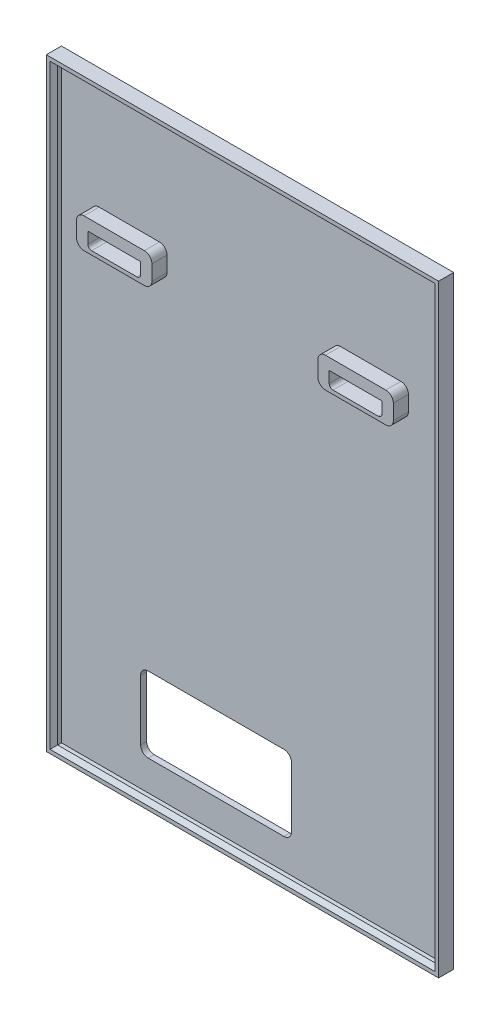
ISO-10303-21;
HEADER;
FILE_DESCRIPTION(('STEP AP214'),'2;1');
FILE_NAME('part.step','',(''),(''),'','','');
FILE_SCHEMA(('AUTOMOTIVE_DESIGN { 1 0 10303 214 1 1 1 1 }'));
ENDSEC;
DATA;
#1=APPLICATION_CONTEXT('core data for automotive mechanical design processes');
#2=APPLICATION_PROTOCOL_DEFINITION('international standard','automotive_design',2000,#1);
#3=PRODUCT_CONTEXT('',#1,'mechanical');
#4=PRODUCT('Part','Part','',(#3));
#5=PRODUCT_RELATED_PRODUCT_CATEGORY('part','',(#4));
#6=PRODUCT_DEFINITION_FORMATION('','',#4);
#7=PRODUCT_DEFINITION_CONTEXT('part definition',#1,'design');
#8=PRODUCT_DEFINITION('design','',#6,#7);
#9=PRODUCT_DEFINITION_SHAPE('','',#8);
#10=(LENGTH_UNIT() NAMED_UNIT(*) SI_UNIT(.MILLI.,.METRE.));
#11=(NAMED_UNIT(*) PLANE_ANGLE_UNIT() SI_UNIT($,.RADIAN.));
#12=(NAMED_UNIT(*) SI_UNIT($,.STERADIAN.) SOLID_ANGLE_UNIT());
#13=UNCERTAINTY_MEASURE_WITH_UNIT(LENGTH_MEASURE(1.E-05),#10,'distance_accuracy_value','');
#14=(GEOMETRIC_REPRESENTATION_CONTEXT(3) GLOBAL_UNCERTAINTY_ASSIGNED_CONTEXT((#13)) GLOBAL_UNIT_ASSIGNED_CONTEXT((#10,
#11,#12)) REPRESENTATION_CONTEXT('',''));
#15=CARTESIAN_POINT('',(0.,0.,0.));
#16=DIRECTION('',(0.,0.,1.));
#17=DIRECTION('',(1.,0.,0.));
#18=AXIS2_PLACEMENT_3D('',#15,#16,#17);
#19=CARTESIAN_POINT('',(0.,-800.,10.));
#20=DIRECTION('',(0.,0.,1.));
#21=DIRECTION('',(1.,0.,0.));
#22=AXIS2_PLACEMENT_3D('',#19,#20,#21);
#23=PLANE('',#22);
#24=CARTESIAN_POINT('',(305.,-740.,10.));
#25=DIRECTION('',(0.,0.,1.));
#26=DIRECTION('',(1.,0.,0.));
#27=AXIS2_PLACEMENT_3D('',#24,#25,#26);
#28=CIRCLE('',#27,10.);
#29=CARTESIAN_POINT('',(305.,-750.,10.));
#30=VERTEX_POINT('',#29);
#31=CARTESIAN_POINT('',(315.,-740.,10.));
#32=VERTEX_POINT('',#31);
#33=EDGE_CURVE('E47',#30,#32,#28,.T.);
#34=ORIENTED_EDGE('',*,*,#33,.F.);
#35=DIRECTION('',(1.,0.,0.));
#36=VECTOR('',#35,1.);
#37=CARTESIAN_POINT('',(125.,-750.,10.));
#38=LINE('',#37,#36);
#39=CARTESIAN_POINT('',(125.,-750.,10.));
#40=VERTEX_POINT('',#39);
#41=EDGE_CURVE('E382',#40,#30,#38,.T.);
#42=ORIENTED_EDGE('',*,*,#41,.F.);
#43=CARTESIAN_POINT('',(125.,-740.,10.));
#44=DIRECTION('',(0.,0.,1.));
#45=DIRECTION('',(1.,0.,0.));
#46=AXIS2_PLACEMENT_3D('',#43,#44,#45);
#47=CIRCLE('',#46,9.99999999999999);
#48=CARTESIAN_POINT('',(115.,-740.,10.));
#49=VERTEX_POINT('',#48);
#50=EDGE_CURVE('E379',#49,#40,#47,.T.);
#51=ORIENTED_EDGE('',*,*,#50,.F.);
#52=DIRECTION('',(0.,-1.,0.));
#53=VECTOR('',#52,1.);
#54=CARTESIAN_POINT('',(115.,-660.,10.));
#55=LINE('',#54,#53);
#56=CARTESIAN_POINT('',(115.,-660.,10.));
#57=VERTEX_POINT('',#56);
#58=EDGE_CURVE('E376',#57,#49,#55,.T.);
#59=ORIENTED_EDGE('',*,*,#58,.F.);
#60=CARTESIAN_POINT('',(125.,-660.,10.));
#61=DIRECTION('',(0.,0.,1.));
#62=DIRECTION('',(1.,0.,0.));
#63=AXIS2_PLACEMENT_3D('',#60,#61,#62);
#64=CIRCLE('',#63,10.);
#65=CARTESIAN_POINT('',(125.,-650.,10.));
#66=VERTEX_POINT('',#65);
#67=EDGE_CURVE('E370',#66,#57,#64,.T.);
#68=ORIENTED_EDGE('',*,*,#67,.F.);
#69=DIRECTION('',(-1.,0.,0.));
#70=VECTOR('',#69,1.);
#71=CARTESIAN_POINT('',(125.,-650.,10.));
#72=LINE('',#71,#70);
#73=CARTESIAN_POINT('',(305.,-650.,10.));
#74=VERTEX_POINT('',#73);
#75=EDGE_CURVE('E368',#74,#66,#72,.T.);
#76=ORIENTED_EDGE('',*,*,#75,.F.);
#77=CARTESIAN_POINT('',(305.,-660.,10.));
#78=DIRECTION('',(0.,0.,1.));
#79=DIRECTION('',(-1.,0.,0.));
#80=AXIS2_PLACEMENT_3D('',#77,#78,#79);
#81=CIRCLE('',#80,9.99999999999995);
#82=CARTESIAN_POINT('',(315.,-660.,10.));
#83=VERTEX_POINT('',#82);
#84=EDGE_CURVE('E352',#83,#74,#81,.T.);
#85=ORIENTED_EDGE('',*,*,#84,.F.);
#86=DIRECTION('',(0.,1.,0.));
#87=VECTOR('',#86,1.);
#88=CARTESIAN_POINT('',(315.,-660.,10.));
#89=LINE('',#88,#87);
#90=EDGE_CURVE('E361',#32,#83,#89,.T.);
#91=ORIENTED_EDGE('',*,*,#90,.F.);
#92=EDGE_LOOP('',(#34,#42,#51,#59,#68,#76,#85,#91));
#93=FACE_BOUND('',#92,.T.);
#94=DIRECTION('',(0.,1.,0.));
#95=VECTOR('',#94,1.);
#96=CARTESIAN_POINT('',(150.,-160.,10.));
#97=LINE('',#96,#95);
#98=CARTESIAN_POINT('',(150.,-180.,10.));
#99=VERTEX_POINT('',#98);
#100=CARTESIAN_POINT('',(150.,-160.,10.));
#101=VERTEX_POINT('',#100);
#102=EDGE_CURVE('E572',#99,#101,#97,.T.);
#103=ORIENTED_EDGE('',*,*,#102,.F.);
#104=CARTESIAN_POINT('',(140.,-180.,10.));
#105=DIRECTION('',(0.,0.,1.));
#106=DIRECTION('',(-1.,0.,0.));
#107=AXIS2_PLACEMENT_3D('',#104,#105,#106);
#108=CIRCLE('',#107,10.);
#109=CARTESIAN_POINT('',(140.,-190.,10.));
#110=VERTEX_POINT('',#109);
#111=EDGE_CURVE('E550',#110,#99,#108,.T.);
#112=ORIENTED_EDGE('',*,*,#111,.F.);
#113=DIRECTION('',(1.,0.,0.));
#114=VECTOR('',#113,1.);
#115=CARTESIAN_POINT('',(60.,-190.,10.));
#116=LINE('',#115,#114);
#117=CARTESIAN_POINT('',(60.,-190.,10.));
#118=VERTEX_POINT('',#117);
#119=EDGE_CURVE('E555',#118,#110,#116,.T.);
#120=ORIENTED_EDGE('',*,*,#119,.F.);
#121=CARTESIAN_POINT('',(60.,-180.,10.));
#122=DIRECTION('',(0.,0.,1.));
#123=DIRECTION('',(1.,0.,0.));
#124=AXIS2_PLACEMENT_3D('',#121,#122,#123);
#125=CIRCLE('',#124,10.);
#126=CARTESIAN_POINT('',(50.,-180.,10.));
#127=VERTEX_POINT('',#126);
#128=EDGE_CURVE('E582',#127,#118,#125,.T.);
#129=ORIENTED_EDGE('',*,*,#128,.F.);
#130=DIRECTION('',(0.,-1.,0.));
#131=VECTOR('',#130,1.);
#132=CARTESIAN_POINT('',(50.,-160.,10.));
#133=LINE('',#132,#131);
#134=CARTESIAN_POINT('',(50.,-160.,10.));
#135=VERTEX_POINT('',#134);
#136=EDGE_CURVE('E580',#135,#127,#133,.T.);
#137=ORIENTED_EDGE('',*,*,#136,.F.);
#138=CARTESIAN_POINT('',(60.,-160.,10.));
#139=DIRECTION('',(0.,0.,1.));
#140=DIRECTION('',(1.,0.,0.));
#141=AXIS2_PLACEMENT_3D('',#138,#139,#140);
#142=CIRCLE('',#141,10.);
#143=CARTESIAN_POINT('',(60.,-150.,10.));
#144=VERTEX_POINT('',#143);
#145=EDGE_CURVE('E578',#144,#135,#142,.T.);
#146=ORIENTED_EDGE('',*,*,#145,.F.);
#147=DIRECTION('',(-1.,0.,0.));
#148=VECTOR('',#147,1.);
#149=CARTESIAN_POINT('',(60.,-150.,10.));
#150=LINE('',#149,#148);
#151=CARTESIAN_POINT('',(140.,-150.,10.));
#152=VERTEX_POINT('',#151);
#153=EDGE_CURVE('E576',#152,#144,#150,.T.);
#154=ORIENTED_EDGE('',*,*,#153,.F.);
#155=CARTESIAN_POINT('',(140.,-160.,10.));
#156=DIRECTION('',(0.,0.,1.));
#157=DIRECTION('',(1.,0.,0.));
#158=AXIS2_PLACEMENT_3D('',#155,#156,#157);
#159=CIRCLE('',#158,10.);
#160=EDGE_CURVE('E574',#101,#152,#159,.T.);
#161=ORIENTED_EDGE('',*,*,#160,.F.);
#162=EDGE_LOOP('',(#103,#112,#120,#129,#137,#146,#154,#161));
#163=FACE_BOUND('',#162,.T.);
#164=DIRECTION('',(0.,-1.,0.));
#165=VECTOR('',#164,1.);
#166=CARTESIAN_POINT('',(10.,0.,10.));
#167=LINE('',#166,#165);
#168=CARTESIAN_POINT('',(10.,-10.,10.));
#169=VERTEX_POINT('',#168);
#170=CARTESIAN_POINT('',(10.0000000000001,-790.,10.));
#171=VERTEX_POINT('',#170);
#172=EDGE_CURVE('E641',#169,#171,#167,.T.);
#173=ORIENTED_EDGE('',*,*,#172,.T.);
#174=DIRECTION('',(1.,0.,0.));
#175=VECTOR('',#174,1.);
#176=CARTESIAN_POINT('',(0.,-790.,10.));
#177=LINE('',#176,#175);
#178=CARTESIAN_POINT('',(510.,-790.,10.));
#179=VERTEX_POINT('',#178);
#180=EDGE_CURVE('E644',#171,#179,#177,.T.);
#181=ORIENTED_EDGE('',*,*,#180,.T.);
#182=DIRECTION('',(0.,1.,0.));
#183=VECTOR('',#182,1.);
#184=CARTESIAN_POINT('',(510.,0.,10.));
#185=LINE('',#184,#183);
#186=CARTESIAN_POINT('',(510.,-10.,10.));
#187=VERTEX_POINT('',#186);
#188=EDGE_CURVE('E655',#179,#187,#185,.T.);
#189=ORIENTED_EDGE('',*,*,#188,.T.);
#190=DIRECTION('',(-1.,0.,0.));
#191=VECTOR('',#190,1.);
#192=CARTESIAN_POINT('',(0.,-10.,10.));
#193=LINE('',#192,#191);
#194=EDGE_CURVE('E652',#187,#169,#193,.T.);
#195=ORIENTED_EDGE('',*,*,#194,.T.);
#196=EDGE_LOOP('',(#173,#181,#189,#195));
#197=FACE_BOUND('',#196,.T.);
#198=DIRECTION('',(0.,1.,0.));
#199=VECTOR('',#198,1.);
#200=CARTESIAN_POINT('',(470.,-160.,10.));
#201=LINE('',#200,#199);
#202=CARTESIAN_POINT('',(470.,-180.,10.));
#203=VERTEX_POINT('',#202);
#204=CARTESIAN_POINT('',(470.,-160.,10.));
#205=VERTEX_POINT('',#204);
#206=EDGE_CURVE('E515',#203,#205,#201,.T.);
#207=ORIENTED_EDGE('',*,*,#206,.F.);
#208=CARTESIAN_POINT('',(460.,-180.,10.));
#209=DIRECTION('',(0.,0.,1.));
#210=DIRECTION('',(-1.,0.,0.));
#211=AXIS2_PLACEMENT_3D('',#208,#209,#210);
#212=CIRCLE('',#211,10.);
#213=CARTESIAN_POINT('',(460.,-190.,10.));
#214=VERTEX_POINT('',#213);
#215=EDGE_CURVE('E483',#214,#203,#212,.T.);
#216=ORIENTED_EDGE('',*,*,#215,.F.);
#217=DIRECTION('',(1.,0.,0.));
#218=VECTOR('',#217,1.);
#219=CARTESIAN_POINT('',(380.,-190.,10.));
#220=LINE('',#219,#218);
#221=CARTESIAN_POINT('',(380.,-190.,10.));
#222=VERTEX_POINT('',#221);
#223=EDGE_CURVE('E498',#222,#214,#220,.T.);
#224=ORIENTED_EDGE('',*,*,#223,.F.);
#225=CARTESIAN_POINT('',(380.,-180.,10.));
#226=DIRECTION('',(0.,0.,1.));
#227=DIRECTION('',(1.,0.,0.));
#228=AXIS2_PLACEMENT_3D('',#225,#226,#227);
#229=CIRCLE('',#228,10.);
#230=CARTESIAN_POINT('',(370.,-180.,10.));
#231=VERTEX_POINT('',#230);
#232=EDGE_CURVE('E525',#231,#222,#229,.T.);
#233=ORIENTED_EDGE('',*,*,#232,.F.);
#234=DIRECTION('',(0.,-1.,0.));
#235=VECTOR('',#234,1.);
#236=CARTESIAN_POINT('',(370.,-160.,10.));
#237=LINE('',#236,#235);
#238=CARTESIAN_POINT('',(370.,-160.,10.));
#239=VERTEX_POINT('',#238);
#240=EDGE_CURVE('E523',#239,#231,#237,.T.);
#241=ORIENTED_EDGE('',*,*,#240,.F.);
#242=CARTESIAN_POINT('',(380.,-160.,10.));
#243=DIRECTION('',(0.,0.,1.));
#244=DIRECTION('',(-1.,0.,0.));
#245=AXIS2_PLACEMENT_3D('',#242,#243,#244);
#246=CIRCLE('',#245,10.);
#247=CARTESIAN_POINT('',(380.,-150.,10.));
#248=VERTEX_POINT('',#247);
#249=EDGE_CURVE('E521',#248,#239,#246,.T.);
#250=ORIENTED_EDGE('',*,*,#249,.F.);
#251=DIRECTION('',(-1.,0.,0.));
#252=VECTOR('',#251,1.);
#253=CARTESIAN_POINT('',(380.,-150.,10.));
#254=LINE('',#253,#252);
#255=CARTESIAN_POINT('',(460.,-150.,10.));
#256=VERTEX_POINT('',#255);
#257=EDGE_CURVE('E519',#256,#248,#254,.T.);
#258=ORIENTED_EDGE('',*,*,#257,.F.);
#259=CARTESIAN_POINT('',(460.,-160.,10.));
#260=DIRECTION('',(0.,0.,1.));
#261=DIRECTION('',(1.,0.,0.));
#262=AXIS2_PLACEMENT_3D('',#259,#260,#261);
#263=CIRCLE('',#262,10.);
#264=EDGE_CURVE('E517',#205,#256,#263,.T.);
#265=ORIENTED_EDGE('',*,*,#264,.F.);
#266=EDGE_LOOP('',(#207,#216,#224,#233,#241,#250,#258,#265));
#267=FACE_BOUND('',#266,.T.);
#268=ADVANCED_FACE('F32',(#93,#163,#197,#267),#23,.T.);
#269=CARTESIAN_POINT('',(0.,0.,20.));
#270=DIRECTION('',(1.,0.,0.));
#271=DIRECTION('',(0.,1.,0.));
#272=AXIS2_PLACEMENT_3D('',#269,#270,#271);
#273=PLANE('',#272);
#274=DIRECTION('',(0.,-1.,0.));
#275=VECTOR('',#274,1.);
#276=CARTESIAN_POINT('',(0.,0.,0.));
#277=LINE('',#276,#275);
#278=CARTESIAN_POINT('',(0.,0.,0.));
#279=VERTEX_POINT('',#278);
#280=CARTESIAN_POINT('',(0.,-800.,0.));
#281=VERTEX_POINT('',#280);
#282=EDGE_CURVE('E647',#279,#281,#277,.T.);
#283=ORIENTED_EDGE('',*,*,#282,.T.);
#284=DIRECTION('',(0.,0.,-1.));
#285=VECTOR('',#284,1.);
#286=CARTESIAN_POINT('',(0.,-800.,20.));
#287=LINE('',#286,#285);
#288=CARTESIAN_POINT('',(0.,-800.,20.));
#289=VERTEX_POINT('',#288);
#290=EDGE_CURVE('E688',#289,#281,#287,.T.);
#291=ORIENTED_EDGE('',*,*,#290,.F.);
#292=DIRECTION('',(0.,-1.,0.));
#293=VECTOR('',#292,1.);
#294=CARTESIAN_POINT('',(0.,0.,20.));
#295=LINE('',#294,#293);
#296=CARTESIAN_POINT('',(0.,0.,20.));
#297=VERTEX_POINT('',#296);
#298=EDGE_CURVE('E662',#297,#289,#295,.T.);
#299=ORIENTED_EDGE('',*,*,#298,.F.);
#300=DIRECTION('',(0.,0.,-1.));
#301=VECTOR('',#300,1.);
#302=CARTESIAN_POINT('',(0.,0.,20.));
#303=LINE('',#302,#301);
#304=EDGE_CURVE('E672',#297,#279,#303,.T.);
#305=ORIENTED_EDGE('',*,*,#304,.T.);
#306=EDGE_LOOP('',(#283,#291,#299,#305));
#307=FACE_BOUND('',#306,.T.);
#308=ADVANCED_FACE('F767',(#307),#273,.F.);
#309=CARTESIAN_POINT('',(0.,-800.,20.));
#310=DIRECTION('',(0.,1.,0.));
#311=DIRECTION('',(0.,0.,1.));
#312=AXIS2_PLACEMENT_3D('',#309,#310,#311);
#313=PLANE('',#312);
#314=DIRECTION('',(1.,0.,0.));
#315=VECTOR('',#314,1.);
#316=CARTESIAN_POINT('',(0.,-800.,0.));
#317=LINE('',#316,#315);
#318=CARTESIAN_POINT('',(520.,-800.,0.));
#319=VERTEX_POINT('',#318);
#320=EDGE_CURVE('E675',#281,#319,#317,.T.);
#321=ORIENTED_EDGE('',*,*,#320,.T.);
#322=DIRECTION('',(0.,0.,-1.));
#323=VECTOR('',#322,1.);
#324=CARTESIAN_POINT('',(520.,-800.,20.));
#325=LINE('',#324,#323);
#326=CARTESIAN_POINT('',(520.,-800.,20.));
#327=VERTEX_POINT('',#326);
#328=EDGE_CURVE('E685',#327,#319,#325,.T.);
#329=ORIENTED_EDGE('',*,*,#328,.F.);
#330=DIRECTION('',(1.,0.,0.));
#331=VECTOR('',#330,1.);
#332=CARTESIAN_POINT('',(0.,-800.,20.));
#333=LINE('',#332,#331);
#334=EDGE_CURVE('E665',#289,#327,#333,.T.);
#335=ORIENTED_EDGE('',*,*,#334,.F.);
#336=ORIENTED_EDGE('',*,*,#290,.T.);
#337=EDGE_LOOP('',(#321,#329,#335,#336));
#338=FACE_BOUND('',#337,.T.);
#339=ADVANCED_FACE('F774',(#338),#313,.F.);
#340=CARTESIAN_POINT('',(520.,0.,20.));
#341=DIRECTION('',(-1.,0.,0.));
#342=DIRECTION('',(0.,-1.,0.));
#343=AXIS2_PLACEMENT_3D('',#340,#341,#342);
#344=PLANE('',#343);
#345=DIRECTION('',(0.,1.,0.));
#346=VECTOR('',#345,1.);
#347=CARTESIAN_POINT('',(520.,0.,0.));
#348=LINE('',#347,#346);
#349=CARTESIAN_POINT('',(520.,0.,0.));
#350=VERTEX_POINT('',#349);
#351=EDGE_CURVE('E677',#319,#350,#348,.T.);
#352=ORIENTED_EDGE('',*,*,#351,.T.);
#353=DIRECTION('',(0.,0.,-1.));
#354=VECTOR('',#353,1.);
#355=CARTESIAN_POINT('',(520.,0.,20.));
#356=LINE('',#355,#354);
#357=CARTESIAN_POINT('',(520.,0.,20.));
#358=VERTEX_POINT('',#357);
#359=EDGE_CURVE('E682',#358,#350,#356,.T.);
#360=ORIENTED_EDGE('',*,*,#359,.F.);
#361=DIRECTION('',(0.,1.,0.));
#362=VECTOR('',#361,1.);
#363=CARTESIAN_POINT('',(520.,0.,20.));
#364=LINE('',#363,#362);
#365=EDGE_CURVE('E668',#327,#358,#364,.T.);
#366=ORIENTED_EDGE('',*,*,#365,.F.);
#367=ORIENTED_EDGE('',*,*,#328,.T.);
#368=EDGE_LOOP('',(#352,#360,#366,#367));
#369=FACE_BOUND('',#368,.T.);
#370=ADVANCED_FACE('F793',(#369),#344,.F.);
#371=CARTESIAN_POINT('',(0.,0.,20.));
#372=DIRECTION('',(0.,-1.,0.));
#373=DIRECTION('',(0.,0.,-1.));
#374=AXIS2_PLACEMENT_3D('',#371,#372,#373);
#375=PLANE('',#374);
#376=DIRECTION('',(-1.,0.,0.));
#377=VECTOR('',#376,1.);
#378=CARTESIAN_POINT('',(0.,0.,0.));
#379=LINE('',#378,#377);
#380=EDGE_CURVE('E666',#350,#279,#379,.T.);
#381=ORIENTED_EDGE('',*,*,#380,.T.);
#382=ORIENTED_EDGE('',*,*,#304,.F.);
#383=DIRECTION('',(-1.,0.,0.));
#384=VECTOR('',#383,1.);
#385=CARTESIAN_POINT('',(0.,0.,20.));
#386=LINE('',#385,#384);
#387=EDGE_CURVE('E670',#358,#297,#386,.T.);
#388=ORIENTED_EDGE('',*,*,#387,.F.);
#389=ORIENTED_EDGE('',*,*,#359,.T.);
#390=EDGE_LOOP('',(#381,#382,#388,#389));
#391=FACE_BOUND('',#390,.T.);
#392=ADVANCED_FACE('F785',(#391),#375,.F.);
#393=CARTESIAN_POINT('',(0.,-800.,20.));
#394=DIRECTION('',(0.,0.,1.));
#395=DIRECTION('',(1.,0.,0.));
#396=AXIS2_PLACEMENT_3D('',#393,#394,#395);
#397=PLANE('',#396);
#398=DIRECTION('',(0.,-1.,0.));
#399=VECTOR('',#398,1.);
#400=CARTESIAN_POINT('',(515.,-800.,20.));
#401=LINE('',#400,#399);
#402=CARTESIAN_POINT('',(515.,-5.,20.));
#403=VERTEX_POINT('',#402);
#404=CARTESIAN_POINT('',(515.,-795.,20.));
#405=VERTEX_POINT('',#404);
#406=EDGE_CURVE('E698',#403,#405,#401,.T.);
#407=ORIENTED_EDGE('',*,*,#406,.T.);
#408=DIRECTION('',(-1.,0.,0.));
#409=VECTOR('',#408,1.);
#410=CARTESIAN_POINT('',(0.,-795.,20.));
#411=LINE('',#410,#409);
#412=CARTESIAN_POINT('',(5.00000000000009,-795.,20.));
#413=VERTEX_POINT('',#412);
#414=EDGE_CURVE('E700',#405,#413,#411,.T.);
#415=ORIENTED_EDGE('',*,*,#414,.T.);
#416=DIRECTION('',(0.,1.,0.));
#417=VECTOR('',#416,1.);
#418=CARTESIAN_POINT('',(5.0000000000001,-800.,20.));
#419=LINE('',#418,#417);
#420=CARTESIAN_POINT('',(5.,-5.,20.));
#421=VERTEX_POINT('',#420);
#422=EDGE_CURVE('E696',#413,#421,#419,.T.);
#423=ORIENTED_EDGE('',*,*,#422,.T.);
#424=DIRECTION('',(1.,0.,0.));
#425=VECTOR('',#424,1.);
#426=CARTESIAN_POINT('',(0.,-5.,20.));
#427=LINE('',#426,#425);
#428=EDGE_CURVE('E694',#421,#403,#427,.T.);
#429=ORIENTED_EDGE('',*,*,#428,.T.);
#430=EDGE_LOOP('',(#407,#415,#423,#429));
#431=FACE_BOUND('',#430,.T.);
#432=ORIENTED_EDGE('',*,*,#298,.T.);
#433=ORIENTED_EDGE('',*,*,#334,.T.);
#434=ORIENTED_EDGE('',*,*,#365,.T.);
#435=ORIENTED_EDGE('',*,*,#387,.T.);
#436=EDGE_LOOP('',(#432,#433,#434,#435));
#437=FACE_BOUND('',#436,.T.);
#438=ADVANCED_FACE('F781',(#431,#437),#397,.T.);
#439=CARTESIAN_POINT('',(0.,-800.,0.));
#440=DIRECTION('',(0.,0.,1.));
#441=DIRECTION('',(1.,0.,0.));
#442=AXIS2_PLACEMENT_3D('',#439,#440,#441);
#443=PLANE('',#442);
#444=DIRECTION('',(-1.,0.,0.));
#445=VECTOR('',#444,1.);
#446=CARTESIAN_POINT('',(0.,-10.,0.));
#447=LINE('',#446,#445);
#448=CARTESIAN_POINT('',(510.,-10.,0.));
#449=VERTEX_POINT('',#448);
#450=CARTESIAN_POINT('',(10.,-10.,0.));
#451=VERTEX_POINT('',#450);
#452=EDGE_CURVE('E615',#449,#451,#447,.T.);
#453=ORIENTED_EDGE('',*,*,#452,.T.);
#454=DIRECTION('',(0.,-1.,0.));
#455=VECTOR('',#454,1.);
#456=CARTESIAN_POINT('',(10.,0.,0.));
#457=LINE('',#456,#455);
#458=CARTESIAN_POINT('',(10.0000000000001,-790.,0.));
#459=VERTEX_POINT('',#458);
#460=EDGE_CURVE('E619',#451,#459,#457,.T.);
#461=ORIENTED_EDGE('',*,*,#460,.T.);
#462=DIRECTION('',(1.,0.,0.));
#463=VECTOR('',#462,1.);
#464=CARTESIAN_POINT('',(0.,-790.,0.));
#465=LINE('',#464,#463);
#466=CARTESIAN_POINT('',(510.,-790.,0.));
#467=VERTEX_POINT('',#466);
#468=EDGE_CURVE('E622',#459,#467,#465,.T.);
#469=ORIENTED_EDGE('',*,*,#468,.T.);
#470=DIRECTION('',(0.,1.,0.));
#471=VECTOR('',#470,1.);
#472=CARTESIAN_POINT('',(510.,0.,0.));
#473=LINE('',#472,#471);
#474=EDGE_CURVE('E626',#467,#449,#473,.T.);
#475=ORIENTED_EDGE('',*,*,#474,.T.);
#476=EDGE_LOOP('',(#453,#461,#469,#475));
#477=FACE_BOUND('',#476,.T.);
#478=ORIENTED_EDGE('',*,*,#282,.F.);
#479=ORIENTED_EDGE('',*,*,#380,.F.);
#480=ORIENTED_EDGE('',*,*,#351,.F.);
#481=ORIENTED_EDGE('',*,*,#320,.F.);
#482=EDGE_LOOP('',(#478,#479,#480,#481));
#483=FACE_BOUND('',#482,.T.);
#484=ADVANCED_FACE('F784',(#477,#483),#443,.F.);
#485=CARTESIAN_POINT('',(10.,0.,20.));
#486=DIRECTION('',(1.,0.,0.));
#487=DIRECTION('',(0.,1.,0.));
#488=AXIS2_PLACEMENT_3D('',#485,#486,#487);
#489=PLANE('',#488);
#490=DIRECTION('',(0.,0.,-1.));
#491=VECTOR('',#490,1.);
#492=CARTESIAN_POINT('',(10.,-10.,20.));
#493=LINE('',#492,#491);
#494=CARTESIAN_POINT('',(10.,-10.,15.));
#495=VERTEX_POINT('',#494);
#496=EDGE_CURVE('E649',#495,#169,#493,.T.);
#497=ORIENTED_EDGE('',*,*,#496,.F.);
#498=DIRECTION('',(0.,-1.,0.));
#499=VECTOR('',#498,1.);
#500=CARTESIAN_POINT('',(10.,0.,15.));
#501=LINE('',#500,#499);
#502=CARTESIAN_POINT('',(10.0000000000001,-790.,15.));
#503=VERTEX_POINT('',#502);
#504=EDGE_CURVE('E705',#495,#503,#501,.T.);
#505=ORIENTED_EDGE('',*,*,#504,.T.);
#506=DIRECTION('',(0.,0.,-1.));
#507=VECTOR('',#506,1.);
#508=CARTESIAN_POINT('',(10.0000000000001,-790.,20.));
#509=LINE('',#508,#507);
#510=EDGE_CURVE('E645',#503,#171,#509,.T.);
#511=ORIENTED_EDGE('',*,*,#510,.T.);
#512=ORIENTED_EDGE('',*,*,#172,.F.);
#513=EDGE_LOOP('',(#497,#505,#511,#512));
#514=FACE_BOUND('',#513,.T.);
#515=ADVANCED_FACE('F789',(#514),#489,.T.);
#516=CARTESIAN_POINT('',(0.,-790.,20.));
#517=DIRECTION('',(0.,1.,0.));
#518=DIRECTION('',(0.,0.,1.));
#519=AXIS2_PLACEMENT_3D('',#516,#517,#518);
#520=PLANE('',#519);
#521=ORIENTED_EDGE('',*,*,#510,.F.);
#522=DIRECTION('',(1.,0.,0.));
#523=VECTOR('',#522,1.);
#524=CARTESIAN_POINT('',(0.,-790.,15.));
#525=LINE('',#524,#523);
#526=CARTESIAN_POINT('',(510.,-790.,15.));
#527=VERTEX_POINT('',#526);
#528=EDGE_CURVE('E691',#503,#527,#525,.T.);
#529=ORIENTED_EDGE('',*,*,#528,.T.);
#530=DIRECTION('',(0.,0.,-1.));
#531=VECTOR('',#530,1.);
#532=CARTESIAN_POINT('',(510.,-790.,20.));
#533=LINE('',#532,#531);
#534=EDGE_CURVE('E648',#527,#179,#533,.T.);
#535=ORIENTED_EDGE('',*,*,#534,.T.);
#536=ORIENTED_EDGE('',*,*,#180,.F.);
#537=EDGE_LOOP('',(#521,#529,#535,#536));
#538=FACE_BOUND('',#537,.T.);
#539=ADVANCED_FACE('F835',(#538),#520,.T.);
#540=CARTESIAN_POINT('',(510.,0.,20.));
#541=DIRECTION('',(-1.,0.,0.));
#542=DIRECTION('',(0.,-1.,0.));
#543=AXIS2_PLACEMENT_3D('',#540,#541,#542);
#544=PLANE('',#543);
#545=ORIENTED_EDGE('',*,*,#534,.F.);
#546=DIRECTION('',(0.,1.,0.));
#547=VECTOR('',#546,1.);
#548=CARTESIAN_POINT('',(510.,0.,15.));
#549=LINE('',#548,#547);
#550=CARTESIAN_POINT('',(510.,-10.,15.));
#551=VERTEX_POINT('',#550);
#552=EDGE_CURVE('E703',#527,#551,#549,.T.);
#553=ORIENTED_EDGE('',*,*,#552,.T.);
#554=DIRECTION('',(0.,0.,-1.));
#555=VECTOR('',#554,1.);
#556=CARTESIAN_POINT('',(510.,-10.,20.));
#557=LINE('',#556,#555);
#558=EDGE_CURVE('E651',#551,#187,#557,.T.);
#559=ORIENTED_EDGE('',*,*,#558,.T.);
#560=ORIENTED_EDGE('',*,*,#188,.F.);
#561=EDGE_LOOP('',(#545,#553,#559,#560));
#562=FACE_BOUND('',#561,.T.);
#563=ADVANCED_FACE('F838',(#562),#544,.T.);
#564=CARTESIAN_POINT('',(0.,-10.,20.));
#565=DIRECTION('',(0.,-1.,0.));
#566=DIRECTION('',(0.,0.,-1.));
#567=AXIS2_PLACEMENT_3D('',#564,#565,#566);
#568=PLANE('',#567);
#569=ORIENTED_EDGE('',*,*,#558,.F.);
#570=DIRECTION('',(-1.,0.,0.));
#571=VECTOR('',#570,1.);
#572=CARTESIAN_POINT('',(0.,-10.,15.));
#573=LINE('',#572,#571);
#574=EDGE_CURVE('E707',#551,#495,#573,.T.);
#575=ORIENTED_EDGE('',*,*,#574,.T.);
#576=ORIENTED_EDGE('',*,*,#496,.T.);
#577=ORIENTED_EDGE('',*,*,#194,.F.);
#578=EDGE_LOOP('',(#569,#575,#576,#577));
#579=FACE_BOUND('',#578,.T.);
#580=ADVANCED_FACE('F779',(#579),#568,.T.);
#581=CARTESIAN_POINT('',(0.,-800.,2.));
#582=DIRECTION('',(0.,0.,1.));
#583=DIRECTION('',(1.,0.,0.));
#584=AXIS2_PLACEMENT_3D('',#581,#582,#583);
#585=PLANE('',#584);
#586=DIRECTION('',(1.,0.,0.));
#587=VECTOR('',#586,1.);
#588=CARTESIAN_POINT('',(0.,-750.,2.));
#589=LINE('',#588,#587);
#590=CARTESIAN_POINT('',(125.,-750.,2.));
#591=VERTEX_POINT('',#590);
#592=CARTESIAN_POINT('',(305.,-750.,2.));
#593=VERTEX_POINT('',#592);
#594=EDGE_CURVE('E40',#591,#593,#589,.T.);
#595=ORIENTED_EDGE('',*,*,#594,.T.);
#596=CARTESIAN_POINT('',(305.,-740.,2.));
#597=DIRECTION('',(0.,0.,1.));
#598=DIRECTION('',(1.,0.,0.));
#599=AXIS2_PLACEMENT_3D('',#596,#597,#598);
#600=CIRCLE('',#599,10.);
#601=CARTESIAN_POINT('',(315.,-740.,2.));
#602=VERTEX_POINT('',#601);
#603=EDGE_CURVE('E11',#593,#602,#600,.T.);
#604=ORIENTED_EDGE('',*,*,#603,.T.);
#605=DIRECTION('',(0.,1.,0.));
#606=VECTOR('',#605,1.);
#607=CARTESIAN_POINT('',(315.,-800.,2.));
#608=LINE('',#607,#606);
#609=CARTESIAN_POINT('',(315.,-660.,2.));
#610=VERTEX_POINT('',#609);
#611=EDGE_CURVE('E709',#602,#610,#608,.T.);
#612=ORIENTED_EDGE('',*,*,#611,.T.);
#613=CARTESIAN_POINT('',(305.,-660.,2.));
#614=DIRECTION('',(0.,0.,1.));
#615=DIRECTION('',(1.,0.,0.));
#616=AXIS2_PLACEMENT_3D('',#613,#614,#615);
#617=CIRCLE('',#616,9.99999999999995);
#618=CARTESIAN_POINT('',(305.,-650.,2.));
#619=VERTEX_POINT('',#618);
#620=EDGE_CURVE('E355',#610,#619,#617,.T.);
#621=ORIENTED_EDGE('',*,*,#620,.T.);
#622=DIRECTION('',(-1.,0.,0.));
#623=VECTOR('',#622,1.);
#624=CARTESIAN_POINT('',(1.90490329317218E-13,-650.,2.));
#625=LINE('',#624,#623);
#626=CARTESIAN_POINT('',(125.,-650.,2.));
#627=VERTEX_POINT('',#626);
#628=EDGE_CURVE('E720',#619,#627,#625,.T.);
#629=ORIENTED_EDGE('',*,*,#628,.T.);
#630=CARTESIAN_POINT('',(125.,-660.,2.));
#631=DIRECTION('',(0.,0.,1.));
#632=DIRECTION('',(1.,0.,0.));
#633=AXIS2_PLACEMENT_3D('',#630,#631,#632);
#634=CIRCLE('',#633,10.);
#635=CARTESIAN_POINT('',(115.,-660.,2.));
#636=VERTEX_POINT('',#635);
#637=EDGE_CURVE('E723',#627,#636,#634,.T.);
#638=ORIENTED_EDGE('',*,*,#637,.T.);
#639=DIRECTION('',(0.,-1.,0.));
#640=VECTOR('',#639,1.);
#641=CARTESIAN_POINT('',(115.,-800.,2.));
#642=LINE('',#641,#640);
#643=CARTESIAN_POINT('',(115.,-740.,2.));
#644=VERTEX_POINT('',#643);
#645=EDGE_CURVE('E726',#636,#644,#642,.T.);
#646=ORIENTED_EDGE('',*,*,#645,.T.);
#647=CARTESIAN_POINT('',(125.,-740.,2.));
#648=DIRECTION('',(0.,0.,1.));
#649=DIRECTION('',(1.,0.,0.));
#650=AXIS2_PLACEMENT_3D('',#647,#648,#649);
#651=CIRCLE('',#650,9.99999999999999);
#652=EDGE_CURVE('E729',#644,#591,#651,.T.);
#653=ORIENTED_EDGE('',*,*,#652,.T.);
#654=EDGE_LOOP('',(#595,#604,#612,#621,#629,#638,#646,#653));
#655=FACE_BOUND('',#654,.T.);
#656=DIRECTION('',(0.,1.,0.));
#657=VECTOR('',#656,1.);
#658=CARTESIAN_POINT('',(510.,0.,2.));
#659=LINE('',#658,#657);
#660=CARTESIAN_POINT('',(510.,-790.,2.));
#661=VERTEX_POINT('',#660);
#662=CARTESIAN_POINT('',(510.,-10.,2.));
#663=VERTEX_POINT('',#662);
#664=EDGE_CURVE('E636',#661,#663,#659,.T.);
#665=ORIENTED_EDGE('',*,*,#664,.F.);
#666=DIRECTION('',(1.,0.,0.));
#667=VECTOR('',#666,1.);
#668=CARTESIAN_POINT('',(0.,-790.,2.));
#669=LINE('',#668,#667);
#670=CARTESIAN_POINT('',(10.0000000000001,-790.,2.));
#671=VERTEX_POINT('',#670);
#672=EDGE_CURVE('E633',#671,#661,#669,.T.);
#673=ORIENTED_EDGE('',*,*,#672,.F.);
#674=DIRECTION('',(0.,-1.,0.));
#675=VECTOR('',#674,1.);
#676=CARTESIAN_POINT('',(10.,0.,2.));
#677=LINE('',#676,#675);
#678=CARTESIAN_POINT('',(10.,-10.,2.));
#679=VERTEX_POINT('',#678);
#680=EDGE_CURVE('E610',#679,#671,#677,.T.);
#681=ORIENTED_EDGE('',*,*,#680,.F.);
#682=DIRECTION('',(-1.,0.,0.));
#683=VECTOR('',#682,1.);
#684=CARTESIAN_POINT('',(0.,-10.,2.));
#685=LINE('',#684,#683);
#686=EDGE_CURVE('E639',#663,#679,#685,.T.);
#687=ORIENTED_EDGE('',*,*,#686,.F.);
#688=EDGE_LOOP('',(#665,#673,#681,#687));
#689=FACE_BOUND('',#688,.T.);
#690=ADVANCED_FACE('F733',(#655,#689),#585,.F.);
#691=CARTESIAN_POINT('',(10.,0.,20.));
#692=DIRECTION('',(1.,0.,0.));
#693=DIRECTION('',(0.,1.,0.));
#694=AXIS2_PLACEMENT_3D('',#691,#692,#693);
#695=PLANE('',#694);
#696=ORIENTED_EDGE('',*,*,#680,.T.);
#697=DIRECTION('',(0.,0.,-1.));
#698=VECTOR('',#697,1.);
#699=CARTESIAN_POINT('',(10.0000000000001,-790.,20.));
#700=LINE('',#699,#698);
#701=EDGE_CURVE('E608',#671,#459,#700,.T.);
#702=ORIENTED_EDGE('',*,*,#701,.T.);
#703=ORIENTED_EDGE('',*,*,#460,.F.);
#704=DIRECTION('',(0.,0.,-1.));
#705=VECTOR('',#704,1.);
#706=CARTESIAN_POINT('',(10.,-10.,20.));
#707=LINE('',#706,#705);
#708=EDGE_CURVE('E612',#679,#451,#707,.T.);
#709=ORIENTED_EDGE('',*,*,#708,.F.);
#710=EDGE_LOOP('',(#696,#702,#703,#709));
#711=FACE_BOUND('',#710,.T.);
#712=ADVANCED_FACE('F861',(#711),#695,.T.);
#713=CARTESIAN_POINT('',(0.,-790.,20.));
#714=DIRECTION('',(0.,1.,0.));
#715=DIRECTION('',(0.,0.,1.));
#716=AXIS2_PLACEMENT_3D('',#713,#714,#715);
#717=PLANE('',#716);
#718=ORIENTED_EDGE('',*,*,#672,.T.);
#719=DIRECTION('',(0.,0.,-1.));
#720=VECTOR('',#719,1.);
#721=CARTESIAN_POINT('',(510.,-790.,20.));
#722=LINE('',#721,#720);
#723=EDGE_CURVE('E611',#661,#467,#722,.T.);
#724=ORIENTED_EDGE('',*,*,#723,.T.);
#725=ORIENTED_EDGE('',*,*,#468,.F.);
#726=ORIENTED_EDGE('',*,*,#701,.F.);
#727=EDGE_LOOP('',(#718,#724,#725,#726));
#728=FACE_BOUND('',#727,.T.);
#729=ADVANCED_FACE('F864',(#728),#717,.T.);
#730=CARTESIAN_POINT('',(510.,0.,20.));
#731=DIRECTION('',(-1.,0.,0.));
#732=DIRECTION('',(0.,-1.,0.));
#733=AXIS2_PLACEMENT_3D('',#730,#731,#732);
#734=PLANE('',#733);
#735=ORIENTED_EDGE('',*,*,#664,.T.);
#736=DIRECTION('',(0.,0.,-1.));
#737=VECTOR('',#736,1.);
#738=CARTESIAN_POINT('',(510.,-10.,20.));
#739=LINE('',#738,#737);
#740=EDGE_CURVE('E614',#663,#449,#739,.T.);
#741=ORIENTED_EDGE('',*,*,#740,.T.);
#742=ORIENTED_EDGE('',*,*,#474,.F.);
#743=ORIENTED_EDGE('',*,*,#723,.F.);
#744=EDGE_LOOP('',(#735,#741,#742,#743));
#745=FACE_BOUND('',#744,.T.);
#746=ADVANCED_FACE('F870',(#745),#734,.T.);
#747=CARTESIAN_POINT('',(0.,-10.,20.));
#748=DIRECTION('',(0.,-1.,0.));
#749=DIRECTION('',(0.,0.,-1.));
#750=AXIS2_PLACEMENT_3D('',#747,#748,#749);
#751=PLANE('',#750);
#752=ORIENTED_EDGE('',*,*,#686,.T.);
#753=ORIENTED_EDGE('',*,*,#708,.T.);
#754=ORIENTED_EDGE('',*,*,#452,.F.);
#755=ORIENTED_EDGE('',*,*,#740,.F.);
#756=EDGE_LOOP('',(#752,#753,#754,#755));
#757=FACE_BOUND('',#756,.T.);
#758=ADVANCED_FACE('F815',(#757),#751,.T.);
#759=CARTESIAN_POINT('',(0.,-10.,15.));
#760=DIRECTION('',(0.,0.707106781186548,-0.707106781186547));
#761=DIRECTION('',(0.,0.707106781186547,0.707106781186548));
#762=AXIS2_PLACEMENT_3D('',#759,#760,#761);
#763=PLANE('',#762);
#764=DIRECTION('',(0.577350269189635,0.577350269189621,0.577350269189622));
#765=VECTOR('',#764,1.);
#766=CARTESIAN_POINT('',(513.333333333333,-6.66666666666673,18.3333333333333));
#767=LINE('',#766,#765);
#768=EDGE_CURVE('E713',#403,#551,#767,.F.);
#769=ORIENTED_EDGE('',*,*,#768,.F.);
#770=ORIENTED_EDGE('',*,*,#428,.F.);
#771=DIRECTION('',(0.577350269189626,-0.577350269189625,-0.577350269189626));
#772=VECTOR('',#771,1.);
#773=CARTESIAN_POINT('',(6.66666666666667,-6.66666666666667,18.3333333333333));
#774=LINE('',#773,#772);
#775=EDGE_CURVE('E623',#495,#421,#774,.F.);
#776=ORIENTED_EDGE('',*,*,#775,.F.);
#777=ORIENTED_EDGE('',*,*,#574,.F.);
#778=EDGE_LOOP('',(#769,#770,#776,#777));
#779=FACE_BOUND('',#778,.T.);
#780=ADVANCED_FACE('F34',(#779),#763,.F.);
#781=CARTESIAN_POINT('',(10.,0.,15.));
#782=DIRECTION('',(-0.707106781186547,0.,-0.707106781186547));
#783=DIRECTION('',(-0.707106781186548,0.,0.707106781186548));
#784=AXIS2_PLACEMENT_3D('',#781,#782,#783);
#785=PLANE('',#784);
#786=ORIENTED_EDGE('',*,*,#775,.T.);
#787=ORIENTED_EDGE('',*,*,#422,.F.);
#788=DIRECTION('',(0.577350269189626,0.577350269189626,-0.577350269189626));
#789=VECTOR('',#788,1.);
#790=CARTESIAN_POINT('',(6.66666666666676,-793.333333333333,18.3333333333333));
#791=LINE('',#790,#789);
#792=EDGE_CURVE('E711',#503,#413,#791,.F.);
#793=ORIENTED_EDGE('',*,*,#792,.F.);
#794=ORIENTED_EDGE('',*,*,#504,.F.);
#795=EDGE_LOOP('',(#786,#787,#793,#794));
#796=FACE_BOUND('',#795,.T.);
#797=ADVANCED_FACE('F808',(#796),#785,.F.);
#798=CARTESIAN_POINT('',(510.,0.,15.));
#799=DIRECTION('',(0.70710678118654,0.,-0.707106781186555));
#800=DIRECTION('',(-0.707106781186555,0.,-0.70710678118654));
#801=AXIS2_PLACEMENT_3D('',#798,#799,#800);
#802=PLANE('',#801);
#803=ORIENTED_EDGE('',*,*,#768,.T.);
#804=ORIENTED_EDGE('',*,*,#552,.F.);
#805=DIRECTION('',(0.577350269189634,-0.577350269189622,0.577350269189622));
#806=VECTOR('',#805,1.);
#807=CARTESIAN_POINT('',(339.999999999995,-619.999999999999,-155.000000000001));
#808=LINE('',#807,#806);
#809=EDGE_CURVE('E607',#405,#527,#808,.F.);
#810=ORIENTED_EDGE('',*,*,#809,.F.);
#811=ORIENTED_EDGE('',*,*,#406,.F.);
#812=EDGE_LOOP('',(#803,#804,#810,#811));
#813=FACE_BOUND('',#812,.T.);
#814=ADVANCED_FACE('F805',(#813),#802,.F.);
#815=CARTESIAN_POINT('',(0.,-790.,15.));
#816=DIRECTION('',(0.,-0.707106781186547,-0.707106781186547));
#817=DIRECTION('',(0.,0.707106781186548,-0.707106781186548));
#818=AXIS2_PLACEMENT_3D('',#815,#816,#817);
#819=PLANE('',#818);
#820=ORIENTED_EDGE('',*,*,#792,.T.);
#821=ORIENTED_EDGE('',*,*,#414,.F.);
#822=ORIENTED_EDGE('',*,*,#809,.T.);
#823=ORIENTED_EDGE('',*,*,#528,.F.);
#824=EDGE_LOOP('',(#820,#821,#822,#823));
#825=FACE_BOUND('',#824,.T.);
#826=ADVANCED_FACE('F801',(#825),#819,.F.);
#827=CARTESIAN_POINT('',(140.,-180.,30.));
#828=DIRECTION('',(0.,0.,-1.));
#829=DIRECTION('',(-1.,0.,0.));
#830=AXIS2_PLACEMENT_3D('',#827,#828,#829);
#831=CYLINDRICAL_SURFACE('',#830,10.);
#832=ORIENTED_EDGE('',*,*,#111,.T.);
#833=DIRECTION('',(0.,0.,-1.));
#834=VECTOR('',#833,1.);
#835=CARTESIAN_POINT('',(150.,-180.,30.));
#836=LINE('',#835,#834);
#837=CARTESIAN_POINT('',(150.,-180.,30.));
#838=VERTEX_POINT('',#837);
#839=EDGE_CURVE('E605',#838,#99,#836,.T.);
#840=ORIENTED_EDGE('',*,*,#839,.F.);
#841=CARTESIAN_POINT('',(140.,-180.,30.));
#842=DIRECTION('',(0.,0.,1.));
#843=DIRECTION('',(-1.,0.,0.));
#844=AXIS2_PLACEMENT_3D('',#841,#842,#843);
#845=CIRCLE('',#844,10.);
#846=CARTESIAN_POINT('',(140.,-190.,30.));
#847=VERTEX_POINT('',#846);
#848=EDGE_CURVE('E551',#847,#838,#845,.T.);
#849=ORIENTED_EDGE('',*,*,#848,.F.);
#850=DIRECTION('',(0.,0.,-1.));
#851=VECTOR('',#850,1.);
#852=CARTESIAN_POINT('',(140.,-190.,30.));
#853=LINE('',#852,#851);
#854=EDGE_CURVE('E569',#847,#110,#853,.T.);
#855=ORIENTED_EDGE('',*,*,#854,.T.);
#856=EDGE_LOOP('',(#832,#840,#849,#855));
#857=FACE_BOUND('',#856,.T.);
#858=ADVANCED_FACE('F804',(#857),#831,.T.);
#859=CARTESIAN_POINT('',(150.,-160.,30.));
#860=DIRECTION('',(-1.,0.,0.));
#861=DIRECTION('',(0.,-1.,0.));
#862=AXIS2_PLACEMENT_3D('',#859,#860,#861);
#863=PLANE('',#862);
#864=ORIENTED_EDGE('',*,*,#102,.T.);
#865=DIRECTION('',(0.,0.,-1.));
#866=VECTOR('',#865,1.);
#867=CARTESIAN_POINT('',(150.,-160.,30.));
#868=LINE('',#867,#866);
#869=CARTESIAN_POINT('',(150.,-160.,30.));
#870=VERTEX_POINT('',#869);
#871=EDGE_CURVE('E602',#870,#101,#868,.T.);
#872=ORIENTED_EDGE('',*,*,#871,.F.);
#873=DIRECTION('',(0.,1.,0.));
#874=VECTOR('',#873,1.);
#875=CARTESIAN_POINT('',(150.,-160.,30.));
#876=LINE('',#875,#874);
#877=EDGE_CURVE('E554',#838,#870,#876,.T.);
#878=ORIENTED_EDGE('',*,*,#877,.F.);
#879=ORIENTED_EDGE('',*,*,#839,.T.);
#880=EDGE_LOOP('',(#864,#872,#878,#879));
#881=FACE_BOUND('',#880,.T.);
#882=ADVANCED_FACE('F937',(#881),#863,.F.);
#883=CARTESIAN_POINT('',(140.,-160.,30.));
#884=DIRECTION('',(0.,0.,-1.));
#885=DIRECTION('',(-1.,0.,0.));
#886=AXIS2_PLACEMENT_3D('',#883,#884,#885);
#887=CYLINDRICAL_SURFACE('',#886,10.);
#888=ORIENTED_EDGE('',*,*,#160,.T.);
#889=DIRECTION('',(0.,0.,-1.));
#890=VECTOR('',#889,1.);
#891=CARTESIAN_POINT('',(140.,-150.,30.));
#892=LINE('',#891,#890);
#893=CARTESIAN_POINT('',(140.,-150.,30.));
#894=VERTEX_POINT('',#893);
#895=EDGE_CURVE('E599',#894,#152,#892,.T.);
#896=ORIENTED_EDGE('',*,*,#895,.F.);
#897=CARTESIAN_POINT('',(140.,-160.,30.));
#898=DIRECTION('',(0.,0.,1.));
#899=DIRECTION('',(1.,0.,0.));
#900=AXIS2_PLACEMENT_3D('',#897,#898,#899);
#901=CIRCLE('',#900,10.);
#902=EDGE_CURVE('E557',#870,#894,#901,.T.);
#903=ORIENTED_EDGE('',*,*,#902,.F.);
#904=ORIENTED_EDGE('',*,*,#871,.T.);
#905=EDGE_LOOP('',(#888,#896,#903,#904));
#906=FACE_BOUND('',#905,.T.);
#907=ADVANCED_FACE('F946',(#906),#887,.T.);
#908=CARTESIAN_POINT('',(60.,-150.,30.));
#909=DIRECTION('',(0.,-1.,0.));
#910=DIRECTION('',(1.,0.,0.));
#911=AXIS2_PLACEMENT_3D('',#908,#909,#910);
#912=PLANE('',#911);
#913=ORIENTED_EDGE('',*,*,#153,.T.);
#914=DIRECTION('',(0.,0.,-1.));
#915=VECTOR('',#914,1.);
#916=CARTESIAN_POINT('',(60.,-150.,30.));
#917=LINE('',#916,#915);
#918=CARTESIAN_POINT('',(60.,-150.,30.));
#919=VERTEX_POINT('',#918);
#920=EDGE_CURVE('E596',#919,#144,#917,.T.);
#921=ORIENTED_EDGE('',*,*,#920,.F.);
#922=DIRECTION('',(-1.,0.,0.));
#923=VECTOR('',#922,1.);
#924=CARTESIAN_POINT('',(60.,-150.,30.));
#925=LINE('',#924,#923);
#926=EDGE_CURVE('E559',#894,#919,#925,.T.);
#927=ORIENTED_EDGE('',*,*,#926,.F.);
#928=ORIENTED_EDGE('',*,*,#895,.T.);
#929=EDGE_LOOP('',(#913,#921,#927,#928));
#930=FACE_BOUND('',#929,.T.);
#931=ADVANCED_FACE('F955',(#930),#912,.F.);
#932=CARTESIAN_POINT('',(60.,-160.,30.));
#933=DIRECTION('',(0.,0.,-1.));
#934=DIRECTION('',(-1.,0.,0.));
#935=AXIS2_PLACEMENT_3D('',#932,#933,#934);
#936=CYLINDRICAL_SURFACE('',#935,10.);
#937=ORIENTED_EDGE('',*,*,#145,.T.);
#938=DIRECTION('',(0.,0.,-1.));
#939=VECTOR('',#938,1.);
#940=CARTESIAN_POINT('',(50.,-160.,30.));
#941=LINE('',#940,#939);
#942=CARTESIAN_POINT('',(50.,-160.,30.));
#943=VERTEX_POINT('',#942);
#944=EDGE_CURVE('E593',#943,#135,#941,.T.);
#945=ORIENTED_EDGE('',*,*,#944,.F.);
#946=CARTESIAN_POINT('',(60.,-160.,30.));
#947=DIRECTION('',(0.,0.,1.));
#948=DIRECTION('',(1.,0.,0.));
#949=AXIS2_PLACEMENT_3D('',#946,#947,#948);
#950=CIRCLE('',#949,10.);
#951=EDGE_CURVE('E561',#919,#943,#950,.T.);
#952=ORIENTED_EDGE('',*,*,#951,.F.);
#953=ORIENTED_EDGE('',*,*,#920,.T.);
#954=EDGE_LOOP('',(#937,#945,#952,#953));
#955=FACE_BOUND('',#954,.T.);
#956=ADVANCED_FACE('F965',(#955),#936,.T.);
#957=CARTESIAN_POINT('',(50.,-160.,30.));
#958=DIRECTION('',(1.,0.,0.));
#959=DIRECTION('',(0.,1.,0.));
#960=AXIS2_PLACEMENT_3D('',#957,#958,#959);
#961=PLANE('',#960);
#962=ORIENTED_EDGE('',*,*,#136,.T.);
#963=DIRECTION('',(0.,0.,-1.));
#964=VECTOR('',#963,1.);
#965=CARTESIAN_POINT('',(50.,-180.,30.));
#966=LINE('',#965,#964);
#967=CARTESIAN_POINT('',(50.,-180.,30.));
#968=VERTEX_POINT('',#967);
#969=EDGE_CURVE('E590',#968,#127,#966,.T.);
#970=ORIENTED_EDGE('',*,*,#969,.F.);
#971=DIRECTION('',(0.,-1.,0.));
#972=VECTOR('',#971,1.);
#973=CARTESIAN_POINT('',(50.,-160.,30.));
#974=LINE('',#973,#972);
#975=EDGE_CURVE('E563',#943,#968,#974,.T.);
#976=ORIENTED_EDGE('',*,*,#975,.F.);
#977=ORIENTED_EDGE('',*,*,#944,.T.);
#978=EDGE_LOOP('',(#962,#970,#976,#977));
#979=FACE_BOUND('',#978,.T.);
#980=ADVANCED_FACE('F975',(#979),#961,.F.);
#981=CARTESIAN_POINT('',(60.,-180.,30.));
#982=DIRECTION('',(0.,0.,-1.));
#983=DIRECTION('',(-1.,0.,0.));
#984=AXIS2_PLACEMENT_3D('',#981,#982,#983);
#985=CYLINDRICAL_SURFACE('',#984,10.);
#986=ORIENTED_EDGE('',*,*,#128,.T.);
#987=DIRECTION('',(0.,0.,-1.));
#988=VECTOR('',#987,1.);
#989=CARTESIAN_POINT('',(60.,-190.,30.));
#990=LINE('',#989,#988);
#991=CARTESIAN_POINT('',(60.,-190.,30.));
#992=VERTEX_POINT('',#991);
#993=EDGE_CURVE('E588',#992,#118,#990,.T.);
#994=ORIENTED_EDGE('',*,*,#993,.F.);
#995=CARTESIAN_POINT('',(60.,-180.,30.));
#996=DIRECTION('',(0.,0.,1.));
#997=DIRECTION('',(1.,0.,0.));
#998=AXIS2_PLACEMENT_3D('',#995,#996,#997);
#999=CIRCLE('',#998,10.);
#1000=EDGE_CURVE('E565',#968,#992,#999,.T.);
#1001=ORIENTED_EDGE('',*,*,#1000,.F.);
#1002=ORIENTED_EDGE('',*,*,#969,.T.);
#1003=EDGE_LOOP('',(#986,#994,#1001,#1002));
#1004=FACE_BOUND('',#1003,.T.);
#1005=ADVANCED_FACE('F985',(#1004),#985,.T.);
#1006=CARTESIAN_POINT('',(60.,-190.,30.));
#1007=DIRECTION('',(0.,1.,0.));
#1008=DIRECTION('',(0.,0.,1.));
#1009=AXIS2_PLACEMENT_3D('',#1006,#1007,#1008);
#1010=PLANE('',#1009);
#1011=ORIENTED_EDGE('',*,*,#119,.T.);
#1012=ORIENTED_EDGE('',*,*,#854,.F.);
#1013=DIRECTION('',(1.,0.,0.));
#1014=VECTOR('',#1013,1.);
#1015=CARTESIAN_POINT('',(60.,-190.,30.));
#1016=LINE('',#1015,#1014);
#1017=EDGE_CURVE('E567',#992,#847,#1016,.T.);
#1018=ORIENTED_EDGE('',*,*,#1017,.F.);
#1019=ORIENTED_EDGE('',*,*,#993,.T.);
#1020=EDGE_LOOP('',(#1011,#1012,#1018,#1019));
#1021=FACE_BOUND('',#1020,.T.);
#1022=ADVANCED_FACE('F995',(#1021),#1010,.F.);
#1023=CARTESIAN_POINT('',(140.,-180.,30.));
#1024=DIRECTION('',(0.,0.,-1.));
#1025=DIRECTION('',(-1.,0.,0.));
#1026=AXIS2_PLACEMENT_3D('',#1023,#1024,#1025);
#1027=PLANE('',#1026);
#1028=CARTESIAN_POINT('',(70.,-180.,30.));
#1029=DIRECTION('',(0.,0.,1.));
#1030=DIRECTION('',(1.,0.,0.));
#1031=AXIS2_PLACEMENT_3D('',#1028,#1029,#1030);
#1032=CIRCLE('',#1031,5.);
#1033=CARTESIAN_POINT('',(65.,-180.,30.));
#1034=VERTEX_POINT('',#1033);
#1035=CARTESIAN_POINT('',(70.,-185.,30.));
#1036=VERTEX_POINT('',#1035);
#1037=EDGE_CURVE('E467',#1034,#1036,#1032,.T.);
#1038=ORIENTED_EDGE('',*,*,#1037,.F.);
#1039=DIRECTION('',(0.,-1.,0.));
#1040=VECTOR('',#1039,1.);
#1041=CARTESIAN_POINT('',(65.,-165.,30.));
#1042=LINE('',#1041,#1040);
#1043=CARTESIAN_POINT('',(65.,-165.,30.));
#1044=VERTEX_POINT('',#1043);
#1045=EDGE_CURVE('E435',#1044,#1034,#1042,.T.);
#1046=ORIENTED_EDGE('',*,*,#1045,.F.);
#1047=DIRECTION('',(-1.,0.,0.));
#1048=VECTOR('',#1047,1.);
#1049=CARTESIAN_POINT('',(65.,-165.,30.));
#1050=LINE('',#1049,#1048);
#1051=CARTESIAN_POINT('',(135.,-165.,30.));
#1052=VERTEX_POINT('',#1051);
#1053=EDGE_CURVE('E450',#1052,#1044,#1050,.T.);
#1054=ORIENTED_EDGE('',*,*,#1053,.F.);
#1055=DIRECTION('',(0.,1.,0.));
#1056=VECTOR('',#1055,1.);
#1057=CARTESIAN_POINT('',(135.,-165.,30.));
#1058=LINE('',#1057,#1056);
#1059=CARTESIAN_POINT('',(135.,-180.,30.));
#1060=VERTEX_POINT('',#1059);
#1061=EDGE_CURVE('E476',#1060,#1052,#1058,.T.);
#1062=ORIENTED_EDGE('',*,*,#1061,.F.);
#1063=CARTESIAN_POINT('',(130.,-180.,30.));
#1064=DIRECTION('',(0.,0.,1.));
#1065=DIRECTION('',(-1.,0.,0.));
#1066=AXIS2_PLACEMENT_3D('',#1063,#1064,#1065);
#1067=CIRCLE('',#1066,4.99999999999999);
#1068=CARTESIAN_POINT('',(130.,-185.,30.));
#1069=VERTEX_POINT('',#1068);
#1070=EDGE_CURVE('E473',#1069,#1060,#1067,.T.);
#1071=ORIENTED_EDGE('',*,*,#1070,.F.);
#1072=DIRECTION('',(1.,0.,0.));
#1073=VECTOR('',#1072,1.);
#1074=CARTESIAN_POINT('',(70.,-185.,30.));
#1075=LINE('',#1074,#1073);
#1076=EDGE_CURVE('E470',#1036,#1069,#1075,.T.);
#1077=ORIENTED_EDGE('',*,*,#1076,.F.);
#1078=EDGE_LOOP('',(#1038,#1046,#1054,#1062,#1071,#1077));
#1079=FACE_BOUND('',#1078,.T.);
#1080=ORIENTED_EDGE('',*,*,#848,.T.);
#1081=ORIENTED_EDGE('',*,*,#877,.T.);
#1082=ORIENTED_EDGE('',*,*,#902,.T.);
#1083=ORIENTED_EDGE('',*,*,#926,.T.);
#1084=ORIENTED_EDGE('',*,*,#951,.T.);
#1085=ORIENTED_EDGE('',*,*,#975,.T.);
#1086=ORIENTED_EDGE('',*,*,#1000,.T.);
#1087=ORIENTED_EDGE('',*,*,#1017,.T.);
#1088=EDGE_LOOP('',(#1080,#1081,#1082,#1083,#1084,#1085,#1086,#1087));
#1089=FACE_BOUND('',#1088,.T.);
#1090=ADVANCED_FACE('F1005',(#1079,#1089),#1027,.F.);
#1091=CARTESIAN_POINT('',(460.,-180.,30.));
#1092=DIRECTION('',(0.,0.,-1.));
#1093=DIRECTION('',(-1.,0.,0.));
#1094=AXIS2_PLACEMENT_3D('',#1091,#1092,#1093);
#1095=CYLINDRICAL_SURFACE('',#1094,10.);
#1096=ORIENTED_EDGE('',*,*,#215,.T.);
#1097=DIRECTION('',(0.,0.,-1.));
#1098=VECTOR('',#1097,1.);
#1099=CARTESIAN_POINT('',(470.,-180.,30.));
#1100=LINE('',#1099,#1098);
#1101=CARTESIAN_POINT('',(470.,-180.,30.));
#1102=VERTEX_POINT('',#1101);
#1103=EDGE_CURVE('E548',#1102,#203,#1100,.T.);
#1104=ORIENTED_EDGE('',*,*,#1103,.F.);
#1105=CARTESIAN_POINT('',(460.,-180.,30.));
#1106=DIRECTION('',(0.,0.,1.));
#1107=DIRECTION('',(-1.,0.,0.));
#1108=AXIS2_PLACEMENT_3D('',#1105,#1106,#1107);
#1109=CIRCLE('',#1108,10.);
#1110=CARTESIAN_POINT('',(460.,-190.,30.));
#1111=VERTEX_POINT('',#1110);
#1112=EDGE_CURVE('E494',#1111,#1102,#1109,.T.);
#1113=ORIENTED_EDGE('',*,*,#1112,.F.);
#1114=DIRECTION('',(0.,0.,-1.));
#1115=VECTOR('',#1114,1.);
#1116=CARTESIAN_POINT('',(460.,-190.,30.));
#1117=LINE('',#1116,#1115);
#1118=EDGE_CURVE('E512',#1111,#214,#1117,.T.);
#1119=ORIENTED_EDGE('',*,*,#1118,.T.);
#1120=EDGE_LOOP('',(#1096,#1104,#1113,#1119));
#1121=FACE_BOUND('',#1120,.T.);
#1122=ADVANCED_FACE('F1013',(#1121),#1095,.T.);
#1123=CARTESIAN_POINT('',(470.,-160.,30.));
#1124=DIRECTION('',(-1.,0.,0.));
#1125=DIRECTION('',(0.,-1.,0.));
#1126=AXIS2_PLACEMENT_3D('',#1123,#1124,#1125);
#1127=PLANE('',#1126);
#1128=ORIENTED_EDGE('',*,*,#206,.T.);
#1129=DIRECTION('',(0.,0.,-1.));
#1130=VECTOR('',#1129,1.);
#1131=CARTESIAN_POINT('',(470.,-160.,30.));
#1132=LINE('',#1131,#1130);
#1133=CARTESIAN_POINT('',(470.,-160.,30.));
#1134=VERTEX_POINT('',#1133);
#1135=EDGE_CURVE('E545',#1134,#205,#1132,.T.);
#1136=ORIENTED_EDGE('',*,*,#1135,.F.);
#1137=DIRECTION('',(0.,1.,0.));
#1138=VECTOR('',#1137,1.);
#1139=CARTESIAN_POINT('',(470.,-160.,30.));
#1140=LINE('',#1139,#1138);
#1141=EDGE_CURVE('E497',#1102,#1134,#1140,.T.);
#1142=ORIENTED_EDGE('',*,*,#1141,.F.);
#1143=ORIENTED_EDGE('',*,*,#1103,.T.);
#1144=EDGE_LOOP('',(#1128,#1136,#1142,#1143));
#1145=FACE_BOUND('',#1144,.T.);
#1146=ADVANCED_FACE('F1018',(#1145),#1127,.F.);
#1147=CARTESIAN_POINT('',(460.,-160.,30.));
#1148=DIRECTION('',(0.,0.,-1.));
#1149=DIRECTION('',(-1.,0.,0.));
#1150=AXIS2_PLACEMENT_3D('',#1147,#1148,#1149);
#1151=CYLINDRICAL_SURFACE('',#1150,10.);
#1152=ORIENTED_EDGE('',*,*,#264,.T.);
#1153=DIRECTION('',(0.,0.,-1.));
#1154=VECTOR('',#1153,1.);
#1155=CARTESIAN_POINT('',(460.,-150.,30.));
#1156=LINE('',#1155,#1154);
#1157=CARTESIAN_POINT('',(460.,-150.,30.));
#1158=VERTEX_POINT('',#1157);
#1159=EDGE_CURVE('E542',#1158,#256,#1156,.T.);
#1160=ORIENTED_EDGE('',*,*,#1159,.F.);
#1161=CARTESIAN_POINT('',(460.,-160.,30.));
#1162=DIRECTION('',(0.,0.,1.));
#1163=DIRECTION('',(1.,0.,0.));
#1164=AXIS2_PLACEMENT_3D('',#1161,#1162,#1163);
#1165=CIRCLE('',#1164,10.);
#1166=EDGE_CURVE('E500',#1134,#1158,#1165,.T.);
#1167=ORIENTED_EDGE('',*,*,#1166,.F.);
#1168=ORIENTED_EDGE('',*,*,#1135,.T.);
#1169=EDGE_LOOP('',(#1152,#1160,#1167,#1168));
#1170=FACE_BOUND('',#1169,.T.);
#1171=ADVANCED_FACE('F1028',(#1170),#1151,.T.);
#1172=CARTESIAN_POINT('',(380.,-150.,30.));
#1173=DIRECTION('',(0.,-1.,0.));
#1174=DIRECTION('',(1.,0.,0.));
#1175=AXIS2_PLACEMENT_3D('',#1172,#1173,#1174);
#1176=PLANE('',#1175);
#1177=ORIENTED_EDGE('',*,*,#257,.T.);
#1178=DIRECTION('',(0.,0.,-1.));
#1179=VECTOR('',#1178,1.);
#1180=CARTESIAN_POINT('',(380.,-150.,30.));
#1181=LINE('',#1180,#1179);
#1182=CARTESIAN_POINT('',(380.,-150.,30.));
#1183=VERTEX_POINT('',#1182);
#1184=EDGE_CURVE('E539',#1183,#248,#1181,.T.);
#1185=ORIENTED_EDGE('',*,*,#1184,.F.);
#1186=DIRECTION('',(-1.,0.,0.));
#1187=VECTOR('',#1186,1.);
#1188=CARTESIAN_POINT('',(380.,-150.,30.));
#1189=LINE('',#1188,#1187);
#1190=EDGE_CURVE('E502',#1158,#1183,#1189,.T.);
#1191=ORIENTED_EDGE('',*,*,#1190,.F.);
#1192=ORIENTED_EDGE('',*,*,#1159,.T.);
#1193=EDGE_LOOP('',(#1177,#1185,#1191,#1192));
#1194=FACE_BOUND('',#1193,.T.);
#1195=ADVANCED_FACE('F1038',(#1194),#1176,.F.);
#1196=CARTESIAN_POINT('',(380.,-160.,30.));
#1197=DIRECTION('',(0.,0.,-1.));
#1198=DIRECTION('',(-1.,0.,0.));
#1199=AXIS2_PLACEMENT_3D('',#1196,#1197,#1198);
#1200=CYLINDRICAL_SURFACE('',#1199,10.);
#1201=ORIENTED_EDGE('',*,*,#249,.T.);
#1202=DIRECTION('',(0.,0.,-1.));
#1203=VECTOR('',#1202,1.);
#1204=CARTESIAN_POINT('',(370.,-160.,30.));
#1205=LINE('',#1204,#1203);
#1206=CARTESIAN_POINT('',(370.,-160.,30.));
#1207=VERTEX_POINT('',#1206);
#1208=EDGE_CURVE('E536',#1207,#239,#1205,.T.);
#1209=ORIENTED_EDGE('',*,*,#1208,.F.);
#1210=CARTESIAN_POINT('',(380.,-160.,30.));
#1211=DIRECTION('',(0.,0.,1.));
#1212=DIRECTION('',(-1.,0.,0.));
#1213=AXIS2_PLACEMENT_3D('',#1210,#1211,#1212);
#1214=CIRCLE('',#1213,10.);
#1215=EDGE_CURVE('E504',#1183,#1207,#1214,.T.);
#1216=ORIENTED_EDGE('',*,*,#1215,.F.);
#1217=ORIENTED_EDGE('',*,*,#1184,.T.);
#1218=EDGE_LOOP('',(#1201,#1209,#1216,#1217));
#1219=FACE_BOUND('',#1218,.T.);
#1220=ADVANCED_FACE('F1048',(#1219),#1200,.T.);
#1221=CARTESIAN_POINT('',(370.,-160.,30.));
#1222=DIRECTION('',(1.,0.,0.));
#1223=DIRECTION('',(0.,1.,0.));
#1224=AXIS2_PLACEMENT_3D('',#1221,#1222,#1223);
#1225=PLANE('',#1224);
#1226=ORIENTED_EDGE('',*,*,#240,.T.);
#1227=DIRECTION('',(0.,0.,-1.));
#1228=VECTOR('',#1227,1.);
#1229=CARTESIAN_POINT('',(370.,-180.,30.));
#1230=LINE('',#1229,#1228);
#1231=CARTESIAN_POINT('',(370.,-180.,30.));
#1232=VERTEX_POINT('',#1231);
#1233=EDGE_CURVE('E533',#1232,#231,#1230,.T.);
#1234=ORIENTED_EDGE('',*,*,#1233,.F.);
#1235=DIRECTION('',(0.,-1.,0.));
#1236=VECTOR('',#1235,1.);
#1237=CARTESIAN_POINT('',(370.,-160.,30.));
#1238=LINE('',#1237,#1236);
#1239=EDGE_CURVE('E506',#1207,#1232,#1238,.T.);
#1240=ORIENTED_EDGE('',*,*,#1239,.F.);
#1241=ORIENTED_EDGE('',*,*,#1208,.T.);
#1242=EDGE_LOOP('',(#1226,#1234,#1240,#1241));
#1243=FACE_BOUND('',#1242,.T.);
#1244=ADVANCED_FACE('F1058',(#1243),#1225,.F.);
#1245=CARTESIAN_POINT('',(380.,-180.,30.));
#1246=DIRECTION('',(0.,0.,-1.));
#1247=DIRECTION('',(-1.,0.,0.));
#1248=AXIS2_PLACEMENT_3D('',#1245,#1246,#1247);
#1249=CYLINDRICAL_SURFACE('',#1248,10.);
#1250=ORIENTED_EDGE('',*,*,#232,.T.);
#1251=DIRECTION('',(0.,0.,-1.));
#1252=VECTOR('',#1251,1.);
#1253=CARTESIAN_POINT('',(380.,-190.,30.));
#1254=LINE('',#1253,#1252);
#1255=CARTESIAN_POINT('',(380.,-190.,30.));
#1256=VERTEX_POINT('',#1255);
#1257=EDGE_CURVE('E531',#1256,#222,#1254,.T.);
#1258=ORIENTED_EDGE('',*,*,#1257,.F.);
#1259=CARTESIAN_POINT('',(380.,-180.,30.));
#1260=DIRECTION('',(0.,0.,1.));
#1261=DIRECTION('',(1.,0.,0.));
#1262=AXIS2_PLACEMENT_3D('',#1259,#1260,#1261);
#1263=CIRCLE('',#1262,10.);
#1264=EDGE_CURVE('E508',#1232,#1256,#1263,.T.);
#1265=ORIENTED_EDGE('',*,*,#1264,.F.);
#1266=ORIENTED_EDGE('',*,*,#1233,.T.);
#1267=EDGE_LOOP('',(#1250,#1258,#1265,#1266));
#1268=FACE_BOUND('',#1267,.T.);
#1269=ADVANCED_FACE('F1068',(#1268),#1249,.T.);
#1270=CARTESIAN_POINT('',(380.,-190.,30.));
#1271=DIRECTION('',(0.,1.,0.));
#1272=DIRECTION('',(-1.,0.,0.));
#1273=AXIS2_PLACEMENT_3D('',#1270,#1271,#1272);
#1274=PLANE('',#1273);
#1275=ORIENTED_EDGE('',*,*,#223,.T.);
#1276=ORIENTED_EDGE('',*,*,#1118,.F.);
#1277=DIRECTION('',(1.,0.,0.));
#1278=VECTOR('',#1277,1.);
#1279=CARTESIAN_POINT('',(380.,-190.,30.));
#1280=LINE('',#1279,#1278);
#1281=EDGE_CURVE('E510',#1256,#1111,#1280,.T.);
#1282=ORIENTED_EDGE('',*,*,#1281,.F.);
#1283=ORIENTED_EDGE('',*,*,#1257,.T.);
#1284=EDGE_LOOP('',(#1275,#1276,#1282,#1283));
#1285=FACE_BOUND('',#1284,.T.);
#1286=ADVANCED_FACE('F1078',(#1285),#1274,.F.);
#1287=CARTESIAN_POINT('',(460.,-180.,30.));
#1288=DIRECTION('',(0.,0.,-1.));
#1289=DIRECTION('',(-1.,0.,0.));
#1290=AXIS2_PLACEMENT_3D('',#1287,#1288,#1289);
#1291=PLANE('',#1290);
#1292=CARTESIAN_POINT('',(390.,-180.,30.));
#1293=DIRECTION('',(0.,0.,1.));
#1294=DIRECTION('',(1.,0.,0.));
#1295=AXIS2_PLACEMENT_3D('',#1292,#1293,#1294);
#1296=CIRCLE('',#1295,4.99999999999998);
#1297=CARTESIAN_POINT('',(385.,-180.,30.));
#1298=VERTEX_POINT('',#1297);
#1299=CARTESIAN_POINT('',(390.,-185.,30.));
#1300=VERTEX_POINT('',#1299);
#1301=EDGE_CURVE('E419',#1298,#1300,#1296,.T.);
#1302=ORIENTED_EDGE('',*,*,#1301,.F.);
#1303=DIRECTION('',(0.,-1.,0.));
#1304=VECTOR('',#1303,1.);
#1305=CARTESIAN_POINT('',(385.,-165.,30.));
#1306=LINE('',#1305,#1304);
#1307=CARTESIAN_POINT('',(385.,-165.,30.));
#1308=VERTEX_POINT('',#1307);
#1309=EDGE_CURVE('E387',#1308,#1298,#1306,.T.);
#1310=ORIENTED_EDGE('',*,*,#1309,.F.);
#1311=DIRECTION('',(-1.,0.,0.));
#1312=VECTOR('',#1311,1.);
#1313=CARTESIAN_POINT('',(385.,-165.,30.));
#1314=LINE('',#1313,#1312);
#1315=CARTESIAN_POINT('',(455.,-165.,30.));
#1316=VERTEX_POINT('',#1315);
#1317=EDGE_CURVE('E402',#1316,#1308,#1314,.T.);
#1318=ORIENTED_EDGE('',*,*,#1317,.F.);
#1319=DIRECTION('',(0.,1.,0.));
#1320=VECTOR('',#1319,1.);
#1321=CARTESIAN_POINT('',(455.,-165.,30.));
#1322=LINE('',#1321,#1320);
#1323=CARTESIAN_POINT('',(455.,-180.,30.));
#1324=VERTEX_POINT('',#1323);
#1325=EDGE_CURVE('E428',#1324,#1316,#1322,.T.);
#1326=ORIENTED_EDGE('',*,*,#1325,.F.);
#1327=CARTESIAN_POINT('',(450.,-180.,30.));
#1328=DIRECTION('',(0.,0.,1.));
#1329=DIRECTION('',(-1.,0.,0.));
#1330=AXIS2_PLACEMENT_3D('',#1327,#1328,#1329);
#1331=CIRCLE('',#1330,4.99999999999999);
#1332=CARTESIAN_POINT('',(450.,-185.,30.));
#1333=VERTEX_POINT('',#1332);
#1334=EDGE_CURVE('E425',#1333,#1324,#1331,.T.);
#1335=ORIENTED_EDGE('',*,*,#1334,.F.);
#1336=DIRECTION('',(1.,0.,0.));
#1337=VECTOR('',#1336,1.);
#1338=CARTESIAN_POINT('',(390.,-185.,30.));
#1339=LINE('',#1338,#1337);
#1340=EDGE_CURVE('E422',#1300,#1333,#1339,.T.);
#1341=ORIENTED_EDGE('',*,*,#1340,.F.);
#1342=EDGE_LOOP('',(#1302,#1310,#1318,#1326,#1335,#1341));
#1343=FACE_BOUND('',#1342,.T.);
#1344=ORIENTED_EDGE('',*,*,#1112,.T.);
#1345=ORIENTED_EDGE('',*,*,#1141,.T.);
#1346=ORIENTED_EDGE('',*,*,#1166,.T.);
#1347=ORIENTED_EDGE('',*,*,#1190,.T.);
#1348=ORIENTED_EDGE('',*,*,#1215,.T.);
#1349=ORIENTED_EDGE('',*,*,#1239,.T.);
#1350=ORIENTED_EDGE('',*,*,#1264,.T.);
#1351=ORIENTED_EDGE('',*,*,#1281,.T.);
#1352=EDGE_LOOP('',(#1344,#1345,#1346,#1347,#1348,#1349,#1350,#1351));
#1353=FACE_BOUND('',#1352,.T.);
#1354=ADVANCED_FACE('F1088',(#1343,#1353),#1291,.F.);
#1355=CARTESIAN_POINT('',(65.,-165.,10.));
#1356=DIRECTION('',(-1.,0.,0.));
#1357=DIRECTION('',(0.,0.,1.));
#1358=AXIS2_PLACEMENT_3D('',#1355,#1356,#1357);
#1359=PLANE('',#1358);
#1360=ORIENTED_EDGE('',*,*,#1045,.T.);
#1361=DIRECTION('',(0.,0.,1.));
#1362=VECTOR('',#1361,1.);
#1363=CARTESIAN_POINT('',(65.,-180.,10.));
#1364=LINE('',#1363,#1362);
#1365=CARTESIAN_POINT('',(65.,-180.,10.));
#1366=VERTEX_POINT('',#1365);
#1367=EDGE_CURVE('E465',#1366,#1034,#1364,.T.);
#1368=ORIENTED_EDGE('',*,*,#1367,.F.);
#1369=DIRECTION('',(0.,-1.,0.));
#1370=VECTOR('',#1369,1.);
#1371=CARTESIAN_POINT('',(65.,-165.,10.));
#1372=LINE('',#1371,#1370);
#1373=CARTESIAN_POINT('',(65.,-165.,10.));
#1374=VERTEX_POINT('',#1373);
#1375=EDGE_CURVE('E446',#1374,#1366,#1372,.T.);
#1376=ORIENTED_EDGE('',*,*,#1375,.F.);
#1377=DIRECTION('',(0.,0.,1.));
#1378=VECTOR('',#1377,1.);
#1379=CARTESIAN_POINT('',(65.,-165.,10.));
#1380=LINE('',#1379,#1378);
#1381=EDGE_CURVE('E481',#1374,#1044,#1380,.T.);
#1382=ORIENTED_EDGE('',*,*,#1381,.T.);
#1383=EDGE_LOOP('',(#1360,#1368,#1376,#1382));
#1384=FACE_BOUND('',#1383,.T.);
#1385=ADVANCED_FACE('F1105',(#1384),#1359,.F.);
#1386=CARTESIAN_POINT('',(65.,-165.,10.));
#1387=DIRECTION('',(0.,1.,0.));
#1388=DIRECTION('',(0.,0.,1.));
#1389=AXIS2_PLACEMENT_3D('',#1386,#1387,#1388);
#1390=PLANE('',#1389);
#1391=ORIENTED_EDGE('',*,*,#1053,.T.);
#1392=ORIENTED_EDGE('',*,*,#1381,.F.);
#1393=DIRECTION('',(-1.,0.,0.));
#1394=VECTOR('',#1393,1.);
#1395=CARTESIAN_POINT('',(65.,-165.,10.));
#1396=LINE('',#1395,#1394);
#1397=CARTESIAN_POINT('',(135.,-165.,10.));
#1398=VERTEX_POINT('',#1397);
#1399=EDGE_CURVE('E462',#1398,#1374,#1396,.T.);
#1400=ORIENTED_EDGE('',*,*,#1399,.F.);
#1401=DIRECTION('',(0.,0.,1.));
#1402=VECTOR('',#1401,1.);
#1403=CARTESIAN_POINT('',(135.,-165.,10.));
#1404=LINE('',#1403,#1402);
#1405=EDGE_CURVE('E484',#1398,#1052,#1404,.T.);
#1406=ORIENTED_EDGE('',*,*,#1405,.T.);
#1407=EDGE_LOOP('',(#1391,#1392,#1400,#1406));
#1408=FACE_BOUND('',#1407,.T.);
#1409=ADVANCED_FACE('F1115',(#1408),#1390,.F.);
#1410=CARTESIAN_POINT('',(135.,-165.,10.));
#1411=DIRECTION('',(1.,0.,0.));
#1412=DIRECTION('',(0.,1.,0.));
#1413=AXIS2_PLACEMENT_3D('',#1410,#1411,#1412);
#1414=PLANE('',#1413);
#1415=ORIENTED_EDGE('',*,*,#1061,.T.);
#1416=ORIENTED_EDGE('',*,*,#1405,.F.);
#1417=DIRECTION('',(0.,1.,0.));
#1418=VECTOR('',#1417,1.);
#1419=CARTESIAN_POINT('',(135.,-165.,10.));
#1420=LINE('',#1419,#1418);
#1421=CARTESIAN_POINT('',(135.,-180.,10.));
#1422=VERTEX_POINT('',#1421);
#1423=EDGE_CURVE('E459',#1422,#1398,#1420,.T.);
#1424=ORIENTED_EDGE('',*,*,#1423,.F.);
#1425=DIRECTION('',(0.,0.,1.));
#1426=VECTOR('',#1425,1.);
#1427=CARTESIAN_POINT('',(135.,-180.,10.));
#1428=LINE('',#1427,#1426);
#1429=EDGE_CURVE('E486',#1422,#1060,#1428,.T.);
#1430=ORIENTED_EDGE('',*,*,#1429,.T.);
#1431=EDGE_LOOP('',(#1415,#1416,#1424,#1430));
#1432=FACE_BOUND('',#1431,.T.);
#1433=ADVANCED_FACE('F1125',(#1432),#1414,.F.);
#1434=CARTESIAN_POINT('',(130.,-180.,10.));
#1435=DIRECTION('',(0.,0.,1.));
#1436=DIRECTION('',(1.,0.,0.));
#1437=AXIS2_PLACEMENT_3D('',#1434,#1435,#1436);
#1438=CYLINDRICAL_SURFACE('',#1437,4.99999999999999);
#1439=ORIENTED_EDGE('',*,*,#1070,.T.);
#1440=ORIENTED_EDGE('',*,*,#1429,.F.);
#1441=CARTESIAN_POINT('',(130.,-180.,10.));
#1442=DIRECTION('',(0.,0.,1.));
#1443=DIRECTION('',(-1.,0.,0.));
#1444=AXIS2_PLACEMENT_3D('',#1441,#1442,#1443);
#1445=CIRCLE('',#1444,4.99999999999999);
#1446=CARTESIAN_POINT('',(130.,-185.,10.));
#1447=VERTEX_POINT('',#1446);
#1448=EDGE_CURVE('E456',#1447,#1422,#1445,.T.);
#1449=ORIENTED_EDGE('',*,*,#1448,.F.);
#1450=DIRECTION('',(0.,0.,1.));
#1451=VECTOR('',#1450,1.);
#1452=CARTESIAN_POINT('',(130.,-185.,10.));
#1453=LINE('',#1452,#1451);
#1454=EDGE_CURVE('E488',#1447,#1069,#1453,.T.);
#1455=ORIENTED_EDGE('',*,*,#1454,.T.);
#1456=EDGE_LOOP('',(#1439,#1440,#1449,#1455));
#1457=FACE_BOUND('',#1456,.T.);
#1458=ADVANCED_FACE('F1135',(#1457),#1438,.F.);
#1459=CARTESIAN_POINT('',(70.,-185.,10.));
#1460=DIRECTION('',(0.,-1.,0.));
#1461=DIRECTION('',(0.,0.,-1.));
#1462=AXIS2_PLACEMENT_3D('',#1459,#1460,#1461);
#1463=PLANE('',#1462);
#1464=ORIENTED_EDGE('',*,*,#1076,.T.);
#1465=ORIENTED_EDGE('',*,*,#1454,.F.);
#1466=DIRECTION('',(1.,0.,0.));
#1467=VECTOR('',#1466,1.);
#1468=CARTESIAN_POINT('',(70.,-185.,10.));
#1469=LINE('',#1468,#1467);
#1470=CARTESIAN_POINT('',(70.,-185.,10.));
#1471=VERTEX_POINT('',#1470);
#1472=EDGE_CURVE('E453',#1471,#1447,#1469,.T.);
#1473=ORIENTED_EDGE('',*,*,#1472,.F.);
#1474=DIRECTION('',(0.,0.,1.));
#1475=VECTOR('',#1474,1.);
#1476=CARTESIAN_POINT('',(70.,-185.,10.));
#1477=LINE('',#1476,#1475);
#1478=EDGE_CURVE('E490',#1471,#1036,#1477,.T.);
#1479=ORIENTED_EDGE('',*,*,#1478,.T.);
#1480=EDGE_LOOP('',(#1464,#1465,#1473,#1479));
#1481=FACE_BOUND('',#1480,.T.);
#1482=ADVANCED_FACE('F1145',(#1481),#1463,.F.);
#1483=CARTESIAN_POINT('',(70.,-180.,10.));
#1484=DIRECTION('',(0.,0.,1.));
#1485=DIRECTION('',(1.,0.,0.));
#1486=AXIS2_PLACEMENT_3D('',#1483,#1484,#1485);
#1487=CYLINDRICAL_SURFACE('',#1486,5.);
#1488=ORIENTED_EDGE('',*,*,#1037,.T.);
#1489=ORIENTED_EDGE('',*,*,#1478,.F.);
#1490=CARTESIAN_POINT('',(70.,-180.,10.));
#1491=DIRECTION('',(0.,0.,1.));
#1492=DIRECTION('',(1.,0.,0.));
#1493=AXIS2_PLACEMENT_3D('',#1490,#1491,#1492);
#1494=CIRCLE('',#1493,5.);
#1495=EDGE_CURVE('E449',#1366,#1471,#1494,.T.);
#1496=ORIENTED_EDGE('',*,*,#1495,.F.);
#1497=ORIENTED_EDGE('',*,*,#1367,.T.);
#1498=EDGE_LOOP('',(#1488,#1489,#1496,#1497));
#1499=FACE_BOUND('',#1498,.T.);
#1500=ADVANCED_FACE('F1155',(#1499),#1487,.F.);
#1501=CARTESIAN_POINT('',(70.,-180.,10.));
#1502=DIRECTION('',(0.,0.,1.));
#1503=DIRECTION('',(1.,0.,0.));
#1504=AXIS2_PLACEMENT_3D('',#1501,#1502,#1503);
#1505=PLANE('',#1504);
#1506=ORIENTED_EDGE('',*,*,#1375,.T.);
#1507=ORIENTED_EDGE('',*,*,#1495,.T.);
#1508=ORIENTED_EDGE('',*,*,#1472,.T.);
#1509=ORIENTED_EDGE('',*,*,#1448,.T.);
#1510=ORIENTED_EDGE('',*,*,#1423,.T.);
#1511=ORIENTED_EDGE('',*,*,#1399,.T.);
#1512=EDGE_LOOP('',(#1506,#1507,#1508,#1509,#1510,#1511));
#1513=FACE_BOUND('',#1512,.T.);
#1514=ADVANCED_FACE('F1165',(#1513),#1505,.T.);
#1515=CARTESIAN_POINT('',(385.,-165.,10.));
#1516=DIRECTION('',(-1.,0.,0.));
#1517=DIRECTION('',(0.,0.,1.));
#1518=AXIS2_PLACEMENT_3D('',#1515,#1516,#1517);
#1519=PLANE('',#1518);
#1520=ORIENTED_EDGE('',*,*,#1309,.T.);
#1521=DIRECTION('',(0.,0.,1.));
#1522=VECTOR('',#1521,1.);
#1523=CARTESIAN_POINT('',(385.,-180.,10.));
#1524=LINE('',#1523,#1522);
#1525=CARTESIAN_POINT('',(385.,-180.,10.));
#1526=VERTEX_POINT('',#1525);
#1527=EDGE_CURVE('E417',#1526,#1298,#1524,.T.);
#1528=ORIENTED_EDGE('',*,*,#1527,.F.);
#1529=DIRECTION('',(0.,-1.,0.));
#1530=VECTOR('',#1529,1.);
#1531=CARTESIAN_POINT('',(385.,-165.,10.));
#1532=LINE('',#1531,#1530);
#1533=CARTESIAN_POINT('',(385.,-165.,10.));
#1534=VERTEX_POINT('',#1533);
#1535=EDGE_CURVE('E398',#1534,#1526,#1532,.T.);
#1536=ORIENTED_EDGE('',*,*,#1535,.F.);
#1537=DIRECTION('',(0.,0.,1.));
#1538=VECTOR('',#1537,1.);
#1539=CARTESIAN_POINT('',(385.,-165.,10.));
#1540=LINE('',#1539,#1538);
#1541=EDGE_CURVE('E433',#1534,#1308,#1540,.T.);
#1542=ORIENTED_EDGE('',*,*,#1541,.T.);
#1543=EDGE_LOOP('',(#1520,#1528,#1536,#1542));
#1544=FACE_BOUND('',#1543,.T.);
#1545=ADVANCED_FACE('F1175',(#1544),#1519,.F.);
#1546=CARTESIAN_POINT('',(385.,-165.,10.));
#1547=DIRECTION('',(0.,1.,0.));
#1548=DIRECTION('',(0.,0.,1.));
#1549=AXIS2_PLACEMENT_3D('',#1546,#1547,#1548);
#1550=PLANE('',#1549);
#1551=ORIENTED_EDGE('',*,*,#1317,.T.);
#1552=ORIENTED_EDGE('',*,*,#1541,.F.);
#1553=DIRECTION('',(-1.,0.,0.));
#1554=VECTOR('',#1553,1.);
#1555=CARTESIAN_POINT('',(385.,-165.,10.));
#1556=LINE('',#1555,#1554);
#1557=CARTESIAN_POINT('',(455.,-165.,10.));
#1558=VERTEX_POINT('',#1557);
#1559=EDGE_CURVE('E414',#1558,#1534,#1556,.T.);
#1560=ORIENTED_EDGE('',*,*,#1559,.F.);
#1561=DIRECTION('',(0.,0.,1.));
#1562=VECTOR('',#1561,1.);
#1563=CARTESIAN_POINT('',(455.,-165.,10.));
#1564=LINE('',#1563,#1562);
#1565=EDGE_CURVE('E436',#1558,#1316,#1564,.T.);
#1566=ORIENTED_EDGE('',*,*,#1565,.T.);
#1567=EDGE_LOOP('',(#1551,#1552,#1560,#1566));
#1568=FACE_BOUND('',#1567,.T.);
#1569=ADVANCED_FACE('F1185',(#1568),#1550,.F.);
#1570=CARTESIAN_POINT('',(455.,-165.,10.));
#1571=DIRECTION('',(1.,0.,0.));
#1572=DIRECTION('',(0.,1.,0.));
#1573=AXIS2_PLACEMENT_3D('',#1570,#1571,#1572);
#1574=PLANE('',#1573);
#1575=ORIENTED_EDGE('',*,*,#1325,.T.);
#1576=ORIENTED_EDGE('',*,*,#1565,.F.);
#1577=DIRECTION('',(0.,1.,0.));
#1578=VECTOR('',#1577,1.);
#1579=CARTESIAN_POINT('',(455.,-165.,10.));
#1580=LINE('',#1579,#1578);
#1581=CARTESIAN_POINT('',(455.,-180.,10.));
#1582=VERTEX_POINT('',#1581);
#1583=EDGE_CURVE('E411',#1582,#1558,#1580,.T.);
#1584=ORIENTED_EDGE('',*,*,#1583,.F.);
#1585=DIRECTION('',(0.,0.,1.));
#1586=VECTOR('',#1585,1.);
#1587=CARTESIAN_POINT('',(455.,-180.,10.));
#1588=LINE('',#1587,#1586);
#1589=EDGE_CURVE('E438',#1582,#1324,#1588,.T.);
#1590=ORIENTED_EDGE('',*,*,#1589,.T.);
#1591=EDGE_LOOP('',(#1575,#1576,#1584,#1590));
#1592=FACE_BOUND('',#1591,.T.);
#1593=ADVANCED_FACE('F1195',(#1592),#1574,.F.);
#1594=CARTESIAN_POINT('',(450.,-180.,10.));
#1595=DIRECTION('',(0.,0.,1.));
#1596=DIRECTION('',(1.,0.,0.));
#1597=AXIS2_PLACEMENT_3D('',#1594,#1595,#1596);
#1598=CYLINDRICAL_SURFACE('',#1597,4.99999999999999);
#1599=ORIENTED_EDGE('',*,*,#1334,.T.);
#1600=ORIENTED_EDGE('',*,*,#1589,.F.);
#1601=CARTESIAN_POINT('',(450.,-180.,10.));
#1602=DIRECTION('',(0.,0.,1.));
#1603=DIRECTION('',(-1.,0.,0.));
#1604=AXIS2_PLACEMENT_3D('',#1601,#1602,#1603);
#1605=CIRCLE('',#1604,4.99999999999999);
#1606=CARTESIAN_POINT('',(450.,-185.,10.));
#1607=VERTEX_POINT('',#1606);
#1608=EDGE_CURVE('E408',#1607,#1582,#1605,.T.);
#1609=ORIENTED_EDGE('',*,*,#1608,.F.);
#1610=DIRECTION('',(0.,0.,1.));
#1611=VECTOR('',#1610,1.);
#1612=CARTESIAN_POINT('',(450.,-185.,10.));
#1613=LINE('',#1612,#1611);
#1614=EDGE_CURVE('E440',#1607,#1333,#1613,.T.);
#1615=ORIENTED_EDGE('',*,*,#1614,.T.);
#1616=EDGE_LOOP('',(#1599,#1600,#1609,#1615));
#1617=FACE_BOUND('',#1616,.T.);
#1618=ADVANCED_FACE('F1205',(#1617),#1598,.F.);
#1619=CARTESIAN_POINT('',(390.,-185.,10.));
#1620=DIRECTION('',(0.,-1.,0.));
#1621=DIRECTION('',(1.,0.,0.));
#1622=AXIS2_PLACEMENT_3D('',#1619,#1620,#1621);
#1623=PLANE('',#1622);
#1624=ORIENTED_EDGE('',*,*,#1340,.T.);
#1625=ORIENTED_EDGE('',*,*,#1614,.F.);
#1626=DIRECTION('',(1.,0.,0.));
#1627=VECTOR('',#1626,1.);
#1628=CARTESIAN_POINT('',(390.,-185.,10.));
#1629=LINE('',#1628,#1627);
#1630=CARTESIAN_POINT('',(390.,-185.,10.));
#1631=VERTEX_POINT('',#1630);
#1632=EDGE_CURVE('E405',#1631,#1607,#1629,.T.);
#1633=ORIENTED_EDGE('',*,*,#1632,.F.);
#1634=DIRECTION('',(0.,0.,1.));
#1635=VECTOR('',#1634,1.);
#1636=CARTESIAN_POINT('',(390.,-185.,10.));
#1637=LINE('',#1636,#1635);
#1638=EDGE_CURVE('E442',#1631,#1300,#1637,.T.);
#1639=ORIENTED_EDGE('',*,*,#1638,.T.);
#1640=EDGE_LOOP('',(#1624,#1625,#1633,#1639));
#1641=FACE_BOUND('',#1640,.T.);
#1642=ADVANCED_FACE('F1215',(#1641),#1623,.F.);
#1643=CARTESIAN_POINT('',(390.,-180.,10.));
#1644=DIRECTION('',(0.,0.,1.));
#1645=DIRECTION('',(1.,0.,0.));
#1646=AXIS2_PLACEMENT_3D('',#1643,#1644,#1645);
#1647=CYLINDRICAL_SURFACE('',#1646,4.99999999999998);
#1648=ORIENTED_EDGE('',*,*,#1301,.T.);
#1649=ORIENTED_EDGE('',*,*,#1638,.F.);
#1650=CARTESIAN_POINT('',(390.,-180.,10.));
#1651=DIRECTION('',(0.,0.,1.));
#1652=DIRECTION('',(1.,0.,0.));
#1653=AXIS2_PLACEMENT_3D('',#1650,#1651,#1652);
#1654=CIRCLE('',#1653,4.99999999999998);
#1655=EDGE_CURVE('E401',#1526,#1631,#1654,.T.);
#1656=ORIENTED_EDGE('',*,*,#1655,.F.);
#1657=ORIENTED_EDGE('',*,*,#1527,.T.);
#1658=EDGE_LOOP('',(#1648,#1649,#1656,#1657));
#1659=FACE_BOUND('',#1658,.T.);
#1660=ADVANCED_FACE('F762',(#1659),#1647,.F.);
#1661=CARTESIAN_POINT('',(390.,-180.,10.));
#1662=DIRECTION('',(0.,0.,1.));
#1663=DIRECTION('',(1.,0.,0.));
#1664=AXIS2_PLACEMENT_3D('',#1661,#1662,#1663);
#1665=PLANE('',#1664);
#1666=ORIENTED_EDGE('',*,*,#1535,.T.);
#1667=ORIENTED_EDGE('',*,*,#1655,.T.);
#1668=ORIENTED_EDGE('',*,*,#1632,.T.);
#1669=ORIENTED_EDGE('',*,*,#1608,.T.);
#1670=ORIENTED_EDGE('',*,*,#1583,.T.);
#1671=ORIENTED_EDGE('',*,*,#1559,.T.);
#1672=EDGE_LOOP('',(#1666,#1667,#1668,#1669,#1670,#1671));
#1673=FACE_BOUND('',#1672,.T.);
#1674=ADVANCED_FACE('F755',(#1673),#1665,.T.);
#1675=CARTESIAN_POINT('',(305.,-740.,0.));
#1676=DIRECTION('',(0.,0.,1.));
#1677=DIRECTION('',(1.,0.,0.));
#1678=AXIS2_PLACEMENT_3D('',#1675,#1676,#1677);
#1679=CYLINDRICAL_SURFACE('',#1678,10.);
#1680=DIRECTION('',(0.,0.,1.));
#1681=VECTOR('',#1680,1.);
#1682=CARTESIAN_POINT('',(305.,-750.,0.));
#1683=LINE('',#1682,#1681);
#1684=EDGE_CURVE('E385',#593,#30,#1683,.T.);
#1685=ORIENTED_EDGE('',*,*,#1684,.T.);
#1686=ORIENTED_EDGE('',*,*,#33,.T.);
#1687=DIRECTION('',(0.,0.,1.));
#1688=VECTOR('',#1687,1.);
#1689=CARTESIAN_POINT('',(315.,-740.,0.));
#1690=LINE('',#1689,#1688);
#1691=EDGE_CURVE('E358',#602,#32,#1690,.T.);
#1692=ORIENTED_EDGE('',*,*,#1691,.F.);
#1693=ORIENTED_EDGE('',*,*,#603,.F.);
#1694=EDGE_LOOP('',(#1685,#1686,#1692,#1693));
#1695=FACE_BOUND('',#1694,.T.);
#1696=ADVANCED_FACE('F753',(#1695),#1679,.F.);
#1697=CARTESIAN_POINT('',(125.,-750.,0.));
#1698=DIRECTION('',(0.,-1.,0.));
#1699=DIRECTION('',(0.,0.,-1.));
#1700=AXIS2_PLACEMENT_3D('',#1697,#1698,#1699);
#1701=PLANE('',#1700);
#1702=DIRECTION('',(0.,0.,1.));
#1703=VECTOR('',#1702,1.);
#1704=CARTESIAN_POINT('',(125.,-750.,0.));
#1705=LINE('',#1704,#1703);
#1706=EDGE_CURVE('E388',#591,#40,#1705,.T.);
#1707=ORIENTED_EDGE('',*,*,#1706,.T.);
#1708=ORIENTED_EDGE('',*,*,#41,.T.);
#1709=ORIENTED_EDGE('',*,*,#1684,.F.);
#1710=ORIENTED_EDGE('',*,*,#594,.F.);
#1711=EDGE_LOOP('',(#1707,#1708,#1709,#1710));
#1712=FACE_BOUND('',#1711,.T.);
#1713=ADVANCED_FACE('F738',(#1712),#1701,.F.);
#1714=CARTESIAN_POINT('',(125.,-740.,0.));
#1715=DIRECTION('',(0.,0.,1.));
#1716=DIRECTION('',(1.,0.,0.));
#1717=AXIS2_PLACEMENT_3D('',#1714,#1715,#1716);
#1718=CYLINDRICAL_SURFACE('',#1717,9.99999999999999);
#1719=DIRECTION('',(0.,0.,1.));
#1720=VECTOR('',#1719,1.);
#1721=CARTESIAN_POINT('',(115.,-740.,0.));
#1722=LINE('',#1721,#1720);
#1723=EDGE_CURVE('E390',#644,#49,#1722,.T.);
#1724=ORIENTED_EDGE('',*,*,#1723,.T.);
#1725=ORIENTED_EDGE('',*,*,#50,.T.);
#1726=ORIENTED_EDGE('',*,*,#1706,.F.);
#1727=ORIENTED_EDGE('',*,*,#652,.F.);
#1728=EDGE_LOOP('',(#1724,#1725,#1726,#1727));
#1729=FACE_BOUND('',#1728,.T.);
#1730=ADVANCED_FACE('F740',(#1729),#1718,.F.);
#1731=CARTESIAN_POINT('',(115.,-660.,0.));
#1732=DIRECTION('',(-1.,0.,0.));
#1733=DIRECTION('',(0.,-1.,0.));
#1734=AXIS2_PLACEMENT_3D('',#1731,#1732,#1733);
#1735=PLANE('',#1734);
#1736=DIRECTION('',(0.,0.,1.));
#1737=VECTOR('',#1736,1.);
#1738=CARTESIAN_POINT('',(115.,-660.,0.));
#1739=LINE('',#1738,#1737);
#1740=EDGE_CURVE('E392',#636,#57,#1739,.T.);
#1741=ORIENTED_EDGE('',*,*,#1740,.T.);
#1742=ORIENTED_EDGE('',*,*,#58,.T.);
#1743=ORIENTED_EDGE('',*,*,#1723,.F.);
#1744=ORIENTED_EDGE('',*,*,#645,.F.);
#1745=EDGE_LOOP('',(#1741,#1742,#1743,#1744));
#1746=FACE_BOUND('',#1745,.T.);
#1747=ADVANCED_FACE('F746',(#1746),#1735,.F.);
#1748=CARTESIAN_POINT('',(125.,-660.,0.));
#1749=DIRECTION('',(0.,0.,1.));
#1750=DIRECTION('',(1.,0.,0.));
#1751=AXIS2_PLACEMENT_3D('',#1748,#1749,#1750);
#1752=CYLINDRICAL_SURFACE('',#1751,10.);
#1753=DIRECTION('',(0.,0.,1.));
#1754=VECTOR('',#1753,1.);
#1755=CARTESIAN_POINT('',(125.,-650.,0.));
#1756=LINE('',#1755,#1754);
#1757=EDGE_CURVE('E394',#627,#66,#1756,.T.);
#1758=ORIENTED_EDGE('',*,*,#1757,.T.);
#1759=ORIENTED_EDGE('',*,*,#67,.T.);
#1760=ORIENTED_EDGE('',*,*,#1740,.F.);
#1761=ORIENTED_EDGE('',*,*,#637,.F.);
#1762=EDGE_LOOP('',(#1758,#1759,#1760,#1761));
#1763=FACE_BOUND('',#1762,.T.);
#1764=ADVANCED_FACE('F749',(#1763),#1752,.F.);
#1765=CARTESIAN_POINT('',(125.,-650.,0.));
#1766=DIRECTION('',(0.,1.,0.));
#1767=DIRECTION('',(-1.,0.,0.));
#1768=AXIS2_PLACEMENT_3D('',#1765,#1766,#1767);
#1769=PLANE('',#1768);
#1770=DIRECTION('',(0.,0.,1.));
#1771=VECTOR('',#1770,1.);
#1772=CARTESIAN_POINT('',(305.,-650.,0.));
#1773=LINE('',#1772,#1771);
#1774=EDGE_CURVE('E357',#619,#74,#1773,.T.);
#1775=ORIENTED_EDGE('',*,*,#1774,.T.);
#1776=ORIENTED_EDGE('',*,*,#75,.T.);
#1777=ORIENTED_EDGE('',*,*,#1757,.F.);
#1778=ORIENTED_EDGE('',*,*,#628,.F.);
#1779=EDGE_LOOP('',(#1775,#1776,#1777,#1778));
#1780=FACE_BOUND('',#1779,.T.);
#1781=ADVANCED_FACE('F752',(#1780),#1769,.F.);
#1782=CARTESIAN_POINT('',(305.,-660.,0.));
#1783=DIRECTION('',(0.,0.,1.));
#1784=DIRECTION('',(1.,0.,0.));
#1785=AXIS2_PLACEMENT_3D('',#1782,#1783,#1784);
#1786=CYLINDRICAL_SURFACE('',#1785,9.99999999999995);
#1787=DIRECTION('',(0.,0.,1.));
#1788=VECTOR('',#1787,1.);
#1789=CARTESIAN_POINT('',(315.,-660.,0.));
#1790=LINE('',#1789,#1788);
#1791=EDGE_CURVE('E55',#610,#83,#1790,.T.);
#1792=ORIENTED_EDGE('',*,*,#1791,.T.);
#1793=ORIENTED_EDGE('',*,*,#84,.T.);
#1794=ORIENTED_EDGE('',*,*,#1774,.F.);
#1795=ORIENTED_EDGE('',*,*,#620,.F.);
#1796=EDGE_LOOP('',(#1792,#1793,#1794,#1795));
#1797=FACE_BOUND('',#1796,.T.);
#1798=ADVANCED_FACE('F349',(#1797),#1786,.F.);
#1799=CARTESIAN_POINT('',(315.,-660.,0.));
#1800=DIRECTION('',(1.,0.,0.));
#1801=DIRECTION('',(0.,0.,-1.));
#1802=AXIS2_PLACEMENT_3D('',#1799,#1800,#1801);
#1803=PLANE('',#1802);
#1804=ORIENTED_EDGE('',*,*,#1691,.T.);
#1805=ORIENTED_EDGE('',*,*,#90,.T.);
#1806=ORIENTED_EDGE('',*,*,#1791,.F.);
#1807=ORIENTED_EDGE('',*,*,#611,.F.);
#1808=EDGE_LOOP('',(#1804,#1805,#1806,#1807));
#1809=FACE_BOUND('',#1808,.T.);
#1810=ADVANCED_FACE('F362',(#1809),#1803,.F.);
#1811=CLOSED_SHELL('',(#268,#308,#339,#370,#392,#438,#484,#515,#539,#563,#580,#690,#712,#729,
#746,#758,#780,#797,#814,#826,#858,#882,#907,#931,#956,#980,#1005,#1022,#1090,#1122,#1146,#1171,
#1195,#1220,#1244,#1269,#1286,#1354,#1385,#1409,#1433,#1458,#1482,#1500,#1514,#1545,#1569,#1593,
#1618,#1642,#1660,#1674,#1696,#1713,#1730,#1747,#1764,#1781,#1798,#1810));
#1812=MANIFOLD_SOLID_BREP('B2',#1811);
#1813=ADVANCED_BREP_SHAPE_REPRESENTATION('',(#18,#1812),#14);
#1814=SHAPE_DEFINITION_REPRESENTATION(#9,#1813);
ENDSEC;
END-ISO-10303-21;
